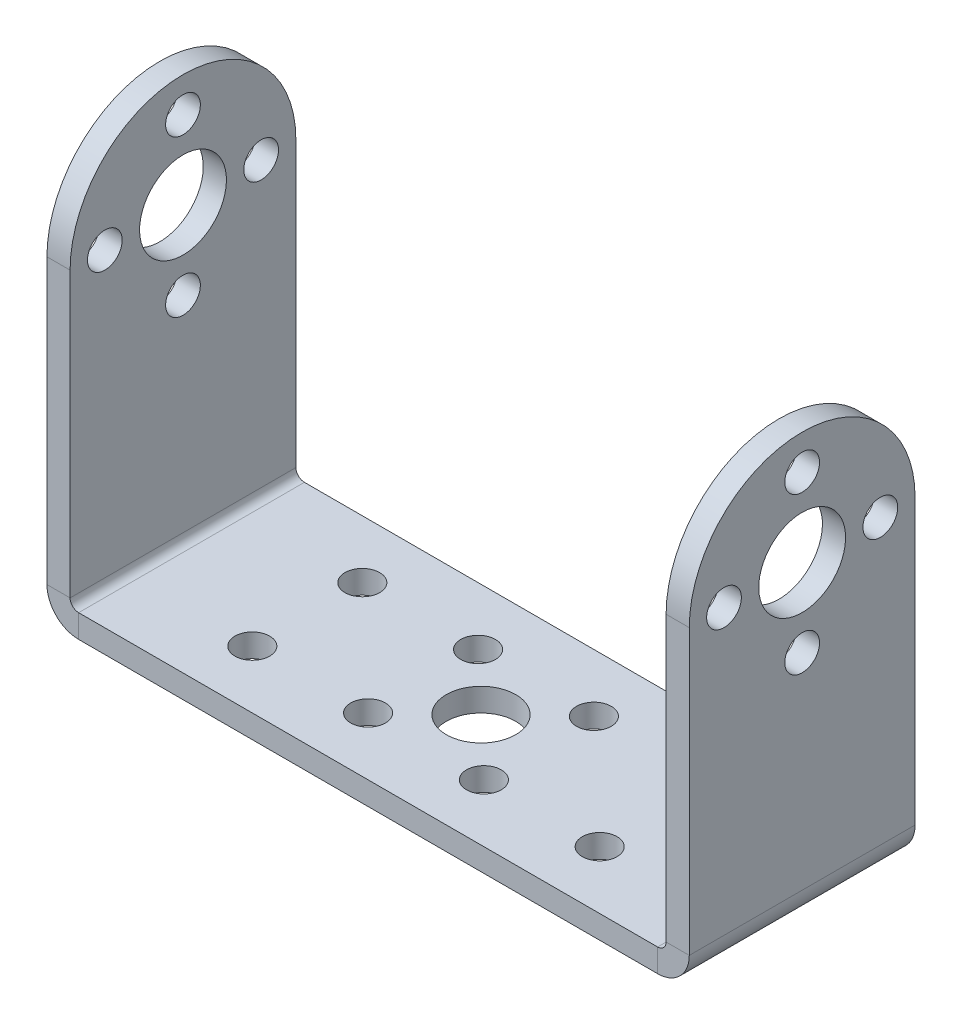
ISO-10303-21;
HEADER;
FILE_DESCRIPTION(('STEP AP214'),'2;1');
FILE_NAME('part.step','',(''),(''),'','','');
FILE_SCHEMA(('AUTOMOTIVE_DESIGN { 1 0 10303 214 1 1 1 1 }'));
ENDSEC;
DATA;
#1=APPLICATION_CONTEXT('core data for automotive mechanical design processes');
#2=APPLICATION_PROTOCOL_DEFINITION('international standard','automotive_design',2000,#1);
#3=PRODUCT_CONTEXT('',#1,'mechanical');
#4=PRODUCT('Part','Part','',(#3));
#5=PRODUCT_RELATED_PRODUCT_CATEGORY('part','',(#4));
#6=PRODUCT_DEFINITION_FORMATION('','',#4);
#7=PRODUCT_DEFINITION_CONTEXT('part definition',#1,'design');
#8=PRODUCT_DEFINITION('design','',#6,#7);
#9=PRODUCT_DEFINITION_SHAPE('','',#8);
#10=(LENGTH_UNIT() NAMED_UNIT(*) SI_UNIT(.MILLI.,.METRE.));
#11=(NAMED_UNIT(*) PLANE_ANGLE_UNIT() SI_UNIT($,.RADIAN.));
#12=(NAMED_UNIT(*) SI_UNIT($,.STERADIAN.) SOLID_ANGLE_UNIT());
#13=UNCERTAINTY_MEASURE_WITH_UNIT(LENGTH_MEASURE(1.E-05),#10,'distance_accuracy_value','');
#14=(GEOMETRIC_REPRESENTATION_CONTEXT(3) GLOBAL_UNCERTAINTY_ASSIGNED_CONTEXT((#13)) GLOBAL_UNIT_ASSIGNED_CONTEXT((#10,
#11,#12)) REPRESENTATION_CONTEXT('',''));
#15=CARTESIAN_POINT('',(0.,0.,0.));
#16=DIRECTION('',(0.,0.,1.));
#17=DIRECTION('',(1.,0.,0.));
#18=AXIS2_PLACEMENT_3D('',#15,#16,#17);
#19=CARTESIAN_POINT('',(-27.7366,0.,0.));
#20=DIRECTION('',(1.,0.,0.));
#21=DIRECTION('',(0.,1.,0.));
#22=AXIS2_PLACEMENT_3D('',#19,#20,#21);
#23=PLANE('',#22);
#24=CARTESIAN_POINT('',(-27.7366000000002,34.0000000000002,0.));
#25=DIRECTION('',(1.,0.,0.));
#26=DIRECTION('',(0.,1.,0.));
#27=AXIS2_PLACEMENT_3D('',#24,#25,#26);
#28=CIRCLE('',#27,1.5);
#29=CARTESIAN_POINT('',(-27.7366000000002,35.5000000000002,0.));
#30=VERTEX_POINT('',#29);
#31=EDGE_CURVE('E994',#30,#30,#28,.T.);
#32=ORIENTED_EDGE('',*,*,#31,.T.);
#33=EDGE_LOOP('',(#32));
#34=FACE_BOUND('',#33,.T.);
#35=CARTESIAN_POINT('',(-27.7366000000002,27.2500000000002,-6.75));
#36=DIRECTION('',(1.,0.,0.));
#37=DIRECTION('',(0.,-1.,0.));
#38=AXIS2_PLACEMENT_3D('',#35,#36,#37);
#39=CIRCLE('',#38,1.5);
#40=CARTESIAN_POINT('',(-27.7366000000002,28.7500000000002,-6.75));
#41=VERTEX_POINT('',#40);
#42=EDGE_CURVE('E982',#41,#41,#39,.T.);
#43=ORIENTED_EDGE('',*,*,#42,.T.);
#44=EDGE_LOOP('',(#43));
#45=FACE_BOUND('',#44,.T.);
#46=CARTESIAN_POINT('',(-27.7366000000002,27.2500000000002,6.75));
#47=DIRECTION('',(1.,0.,0.));
#48=DIRECTION('',(0.,1.,0.));
#49=AXIS2_PLACEMENT_3D('',#46,#47,#48);
#50=CIRCLE('',#49,1.5);
#51=CARTESIAN_POINT('',(-27.7366000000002,28.7500000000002,6.75));
#52=VERTEX_POINT('',#51);
#53=EDGE_CURVE('E983',#52,#52,#50,.T.);
#54=ORIENTED_EDGE('',*,*,#53,.T.);
#55=EDGE_LOOP('',(#54));
#56=FACE_BOUND('',#55,.T.);
#57=CARTESIAN_POINT('',(-27.7366000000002,20.5000000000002,0.));
#58=DIRECTION('',(1.,0.,0.));
#59=DIRECTION('',(0.,-1.,0.));
#60=AXIS2_PLACEMENT_3D('',#57,#58,#59);
#61=CIRCLE('',#60,1.5);
#62=CARTESIAN_POINT('',(-27.7366000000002,22.0000000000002,0.));
#63=VERTEX_POINT('',#62);
#64=EDGE_CURVE('E965',#63,#63,#61,.T.);
#65=ORIENTED_EDGE('',*,*,#64,.T.);
#66=EDGE_LOOP('',(#65));
#67=FACE_BOUND('',#66,.T.);
#68=CARTESIAN_POINT('',(-27.7366000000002,27.2500000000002,0.));
#69=DIRECTION('',(1.,0.,0.));
#70=DIRECTION('',(0.,1.,0.));
#71=AXIS2_PLACEMENT_3D('',#68,#69,#70);
#72=CIRCLE('',#71,3.75);
#73=CARTESIAN_POINT('',(-27.7366000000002,31.0000000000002,0.));
#74=VERTEX_POINT('',#73);
#75=EDGE_CURVE('E289',#74,#74,#72,.T.);
#76=ORIENTED_EDGE('',*,*,#75,.T.);
#77=EDGE_LOOP('',(#76));
#78=FACE_BOUND('',#77,.T.);
#79=CARTESIAN_POINT('',(-27.7366000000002,27.2500000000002,0.));
#80=DIRECTION('',(1.,0.,0.));
#81=DIRECTION('',(0.,1.,0.));
#82=AXIS2_PLACEMENT_3D('',#79,#80,#81);
#83=CIRCLE('',#82,9.75);
#84=CARTESIAN_POINT('',(-27.7366000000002,27.2500000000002,-9.75));
#85=VERTEX_POINT('',#84);
#86=CARTESIAN_POINT('',(-27.7366000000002,27.2500000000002,9.75));
#87=VERTEX_POINT('',#86);
#88=EDGE_CURVE('E328',#85,#87,#83,.T.);
#89=ORIENTED_EDGE('',*,*,#88,.F.);
#90=DIRECTION('',(0.,-1.,0.));
#91=VECTOR('',#90,1.);
#92=CARTESIAN_POINT('',(-27.7366,0.,-9.75));
#93=LINE('',#92,#91);
#94=CARTESIAN_POINT('',(-27.7366,2.73659999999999,-9.75));
#95=VERTEX_POINT('',#94);
#96=EDGE_CURVE('E254',#85,#95,#93,.T.);
#97=ORIENTED_EDGE('',*,*,#96,.T.);
#98=DIRECTION('',(0.,0.,1.));
#99=VECTOR('',#98,1.);
#100=CARTESIAN_POINT('',(-27.7366,2.73659999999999,-9.75));
#101=LINE('',#100,#99);
#102=CARTESIAN_POINT('',(-27.7366,2.73659999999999,9.75));
#103=VERTEX_POINT('',#102);
#104=EDGE_CURVE('E399',#103,#95,#101,.F.);
#105=ORIENTED_EDGE('',*,*,#104,.F.);
#106=DIRECTION('',(0.,1.,0.));
#107=VECTOR('',#106,1.);
#108=CARTESIAN_POINT('',(-27.7366,0.,9.75));
#109=LINE('',#108,#107);
#110=EDGE_CURVE('E388',#103,#87,#109,.T.);
#111=ORIENTED_EDGE('',*,*,#110,.T.);
#112=EDGE_LOOP('',(#89,#97,#105,#111));
#113=FACE_BOUND('',#112,.T.);
#114=ADVANCED_FACE('F95',(#34,#45,#56,#67,#78,#113),#23,.F.);
#115=CARTESIAN_POINT('',(-25.7366,0.,0.));
#116=DIRECTION('',(1.,0.,0.));
#117=DIRECTION('',(0.,1.,0.));
#118=AXIS2_PLACEMENT_3D('',#115,#116,#117);
#119=PLANE('',#118);
#120=CARTESIAN_POINT('',(-25.7366000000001,34.0000000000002,0.));
#121=DIRECTION('',(1.,0.,0.));
#122=DIRECTION('',(0.,1.,0.));
#123=AXIS2_PLACEMENT_3D('',#120,#121,#122);
#124=CIRCLE('',#123,1.5);
#125=CARTESIAN_POINT('',(-25.7366000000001,35.5000000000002,0.));
#126=VERTEX_POINT('',#125);
#127=EDGE_CURVE('E320',#126,#126,#124,.T.);
#128=ORIENTED_EDGE('',*,*,#127,.F.);
#129=EDGE_LOOP('',(#128));
#130=FACE_BOUND('',#129,.T.);
#131=CARTESIAN_POINT('',(-25.7366000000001,27.2500000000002,-6.75));
#132=DIRECTION('',(1.,0.,0.));
#133=DIRECTION('',(0.,1.,0.));
#134=AXIS2_PLACEMENT_3D('',#131,#132,#133);
#135=CIRCLE('',#134,1.5);
#136=CARTESIAN_POINT('',(-25.7366000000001,28.7500000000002,-6.75));
#137=VERTEX_POINT('',#136);
#138=EDGE_CURVE('E302',#137,#137,#135,.T.);
#139=ORIENTED_EDGE('',*,*,#138,.F.);
#140=EDGE_LOOP('',(#139));
#141=FACE_BOUND('',#140,.T.);
#142=CARTESIAN_POINT('',(-25.7366000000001,27.2500000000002,6.75));
#143=DIRECTION('',(1.,0.,0.));
#144=DIRECTION('',(0.,1.,0.));
#145=AXIS2_PLACEMENT_3D('',#142,#143,#144);
#146=CIRCLE('',#145,1.5);
#147=CARTESIAN_POINT('',(-25.7366000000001,28.7500000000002,6.75));
#148=VERTEX_POINT('',#147);
#149=EDGE_CURVE('E298',#148,#148,#146,.T.);
#150=ORIENTED_EDGE('',*,*,#149,.F.);
#151=EDGE_LOOP('',(#150));
#152=FACE_BOUND('',#151,.T.);
#153=CARTESIAN_POINT('',(-25.7366000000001,20.5000000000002,0.));
#154=DIRECTION('',(1.,0.,0.));
#155=DIRECTION('',(0.,1.,0.));
#156=AXIS2_PLACEMENT_3D('',#153,#154,#155);
#157=CIRCLE('',#156,1.5);
#158=CARTESIAN_POINT('',(-25.7366000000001,22.0000000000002,0.));
#159=VERTEX_POINT('',#158);
#160=EDGE_CURVE('E294',#159,#159,#157,.T.);
#161=ORIENTED_EDGE('',*,*,#160,.F.);
#162=EDGE_LOOP('',(#161));
#163=FACE_BOUND('',#162,.T.);
#164=CARTESIAN_POINT('',(-25.7366000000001,27.2500000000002,0.));
#165=DIRECTION('',(1.,0.,0.));
#166=DIRECTION('',(0.,1.,0.));
#167=AXIS2_PLACEMENT_3D('',#164,#165,#166);
#168=CIRCLE('',#167,3.75);
#169=CARTESIAN_POINT('',(-25.7366000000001,31.0000000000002,0.));
#170=VERTEX_POINT('',#169);
#171=EDGE_CURVE('E288',#170,#170,#168,.T.);
#172=ORIENTED_EDGE('',*,*,#171,.F.);
#173=EDGE_LOOP('',(#172));
#174=FACE_BOUND('',#173,.T.);
#175=DIRECTION('',(0.,1.,0.));
#176=VECTOR('',#175,1.);
#177=CARTESIAN_POINT('',(-25.7366,2.,-9.75));
#178=LINE('',#177,#176);
#179=CARTESIAN_POINT('',(-25.7366000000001,27.2500000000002,-9.75));
#180=VERTEX_POINT('',#179);
#181=CARTESIAN_POINT('',(-25.7366,2.7366,-9.75));
#182=VERTEX_POINT('',#181);
#183=EDGE_CURVE('E392',#180,#182,#178,.F.);
#184=ORIENTED_EDGE('',*,*,#183,.F.);
#185=CARTESIAN_POINT('',(-25.7366000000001,27.2500000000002,0.));
#186=DIRECTION('',(1.,0.,0.));
#187=DIRECTION('',(0.,1.,0.));
#188=AXIS2_PLACEMENT_3D('',#185,#186,#187);
#189=CIRCLE('',#188,9.75);
#190=CARTESIAN_POINT('',(-25.7366000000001,27.2500000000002,9.75));
#191=VERTEX_POINT('',#190);
#192=EDGE_CURVE('E283',#180,#191,#189,.T.);
#193=ORIENTED_EDGE('',*,*,#192,.T.);
#194=DIRECTION('',(0.,-1.,0.));
#195=VECTOR('',#194,1.);
#196=CARTESIAN_POINT('',(-25.7366000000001,37.,9.74999999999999));
#197=LINE('',#196,#195);
#198=CARTESIAN_POINT('',(-25.7366,2.7366,9.75));
#199=VERTEX_POINT('',#198);
#200=EDGE_CURVE('E395',#199,#191,#197,.F.);
#201=ORIENTED_EDGE('',*,*,#200,.F.);
#202=DIRECTION('',(0.,0.,1.));
#203=VECTOR('',#202,1.);
#204=CARTESIAN_POINT('',(-25.7366,2.7366,-9.75));
#205=LINE('',#204,#203);
#206=EDGE_CURVE('E406',#182,#199,#205,.T.);
#207=ORIENTED_EDGE('',*,*,#206,.F.);
#208=EDGE_LOOP('',(#184,#193,#201,#207));
#209=FACE_BOUND('',#208,.T.);
#210=ADVANCED_FACE('F417',(#130,#141,#152,#163,#174,#209),#119,.T.);
#211=CARTESIAN_POINT('',(27.7366,0.,0.));
#212=DIRECTION('',(-1.,0.,0.));
#213=DIRECTION('',(0.,-1.,0.));
#214=AXIS2_PLACEMENT_3D('',#211,#212,#213);
#215=PLANE('',#214);
#216=CARTESIAN_POINT('',(27.7366000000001,34.,0.));
#217=DIRECTION('',(1.,0.,0.));
#218=DIRECTION('',(0.,1.,0.));
#219=AXIS2_PLACEMENT_3D('',#216,#217,#218);
#220=CIRCLE('',#219,1.5);
#221=CARTESIAN_POINT('',(27.7366000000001,35.5,0.));
#222=VERTEX_POINT('',#221);
#223=EDGE_CURVE('E989',#222,#222,#220,.T.);
#224=ORIENTED_EDGE('',*,*,#223,.F.);
#225=EDGE_LOOP('',(#224));
#226=FACE_BOUND('',#225,.T.);
#227=CARTESIAN_POINT('',(27.7366000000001,27.25,-6.75));
#228=DIRECTION('',(1.,0.,0.));
#229=DIRECTION('',(0.,-1.,0.));
#230=AXIS2_PLACEMENT_3D('',#227,#228,#229);
#231=CIRCLE('',#230,1.5);
#232=CARTESIAN_POINT('',(27.7366000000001,28.75,-6.75));
#233=VERTEX_POINT('',#232);
#234=EDGE_CURVE('E997',#233,#233,#231,.T.);
#235=ORIENTED_EDGE('',*,*,#234,.F.);
#236=EDGE_LOOP('',(#235));
#237=FACE_BOUND('',#236,.T.);
#238=CARTESIAN_POINT('',(27.7366000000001,27.25,6.75));
#239=DIRECTION('',(1.,0.,0.));
#240=DIRECTION('',(0.,1.,0.));
#241=AXIS2_PLACEMENT_3D('',#238,#239,#240);
#242=CIRCLE('',#241,1.5);
#243=CARTESIAN_POINT('',(27.7366000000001,28.75,6.75));
#244=VERTEX_POINT('',#243);
#245=EDGE_CURVE('E979',#244,#244,#242,.T.);
#246=ORIENTED_EDGE('',*,*,#245,.F.);
#247=EDGE_LOOP('',(#246));
#248=FACE_BOUND('',#247,.T.);
#249=CARTESIAN_POINT('',(27.7366000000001,20.5,0.));
#250=DIRECTION('',(1.,0.,0.));
#251=DIRECTION('',(0.,-1.,0.));
#252=AXIS2_PLACEMENT_3D('',#249,#250,#251);
#253=CIRCLE('',#252,1.5);
#254=CARTESIAN_POINT('',(27.7366000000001,22.,0.));
#255=VERTEX_POINT('',#254);
#256=EDGE_CURVE('E971',#255,#255,#253,.T.);
#257=ORIENTED_EDGE('',*,*,#256,.F.);
#258=EDGE_LOOP('',(#257));
#259=FACE_BOUND('',#258,.T.);
#260=CARTESIAN_POINT('',(27.7366000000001,27.25,0.));
#261=DIRECTION('',(1.,0.,0.));
#262=DIRECTION('',(0.,1.,0.));
#263=AXIS2_PLACEMENT_3D('',#260,#261,#262);
#264=CIRCLE('',#263,3.75);
#265=CARTESIAN_POINT('',(27.7366000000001,31.,0.));
#266=VERTEX_POINT('',#265);
#267=EDGE_CURVE('E993',#266,#266,#264,.T.);
#268=ORIENTED_EDGE('',*,*,#267,.F.);
#269=EDGE_LOOP('',(#268));
#270=FACE_BOUND('',#269,.T.);
#271=DIRECTION('',(0.,1.,0.));
#272=VECTOR('',#271,1.);
#273=CARTESIAN_POINT('',(27.7366,0.,-9.75));
#274=LINE('',#273,#272);
#275=CARTESIAN_POINT('',(27.7366,2.73659999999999,-9.75));
#276=VERTEX_POINT('',#275);
#277=CARTESIAN_POINT('',(27.7366000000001,27.25,-9.75));
#278=VERTEX_POINT('',#277);
#279=EDGE_CURVE('E348',#276,#278,#274,.T.);
#280=ORIENTED_EDGE('',*,*,#279,.T.);
#281=CARTESIAN_POINT('',(27.7366000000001,27.25,0.));
#282=DIRECTION('',(1.,0.,0.));
#283=DIRECTION('',(0.,1.,0.));
#284=AXIS2_PLACEMENT_3D('',#281,#282,#283);
#285=CIRCLE('',#284,9.75);
#286=CARTESIAN_POINT('',(27.7366000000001,27.25,9.75));
#287=VERTEX_POINT('',#286);
#288=EDGE_CURVE('E280',#278,#287,#285,.T.);
#289=ORIENTED_EDGE('',*,*,#288,.T.);
#290=DIRECTION('',(0.,-1.,0.));
#291=VECTOR('',#290,1.);
#292=CARTESIAN_POINT('',(27.7366,0.,9.75));
#293=LINE('',#292,#291);
#294=CARTESIAN_POINT('',(27.7366,2.73659999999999,9.75));
#295=VERTEX_POINT('',#294);
#296=EDGE_CURVE('E344',#287,#295,#293,.T.);
#297=ORIENTED_EDGE('',*,*,#296,.T.);
#298=DIRECTION('',(0.,0.,-1.));
#299=VECTOR('',#298,1.);
#300=CARTESIAN_POINT('',(27.7366,2.73659999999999,9.75));
#301=LINE('',#300,#299);
#302=EDGE_CURVE('E359',#276,#295,#301,.F.);
#303=ORIENTED_EDGE('',*,*,#302,.F.);
#304=EDGE_LOOP('',(#280,#289,#297,#303));
#305=FACE_BOUND('',#304,.T.);
#306=ADVANCED_FACE('F457',(#226,#237,#248,#259,#270,#305),#215,.F.);
#307=CARTESIAN_POINT('',(25.7366,0.,0.));
#308=DIRECTION('',(-1.,0.,0.));
#309=DIRECTION('',(0.,-1.,0.));
#310=AXIS2_PLACEMENT_3D('',#307,#308,#309);
#311=PLANE('',#310);
#312=CARTESIAN_POINT('',(25.7366000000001,34.,0.));
#313=DIRECTION('',(-1.,0.,0.));
#314=DIRECTION('',(0.,-1.,0.));
#315=AXIS2_PLACEMENT_3D('',#312,#313,#314);
#316=CIRCLE('',#315,1.5);
#317=CARTESIAN_POINT('',(25.7366000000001,35.5,0.));
#318=VERTEX_POINT('',#317);
#319=EDGE_CURVE('E99',#318,#318,#316,.T.);
#320=ORIENTED_EDGE('',*,*,#319,.F.);
#321=EDGE_LOOP('',(#320));
#322=FACE_BOUND('',#321,.T.);
#323=CARTESIAN_POINT('',(25.7366000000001,27.25,-6.75));
#324=DIRECTION('',(-1.,0.,0.));
#325=DIRECTION('',(0.,-1.,0.));
#326=AXIS2_PLACEMENT_3D('',#323,#324,#325);
#327=CIRCLE('',#326,1.5);
#328=CARTESIAN_POINT('',(25.7366000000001,28.75,-6.75));
#329=VERTEX_POINT('',#328);
#330=EDGE_CURVE('E299',#329,#329,#327,.T.);
#331=ORIENTED_EDGE('',*,*,#330,.F.);
#332=EDGE_LOOP('',(#331));
#333=FACE_BOUND('',#332,.T.);
#334=CARTESIAN_POINT('',(25.7366000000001,27.25,6.75));
#335=DIRECTION('',(-1.,0.,0.));
#336=DIRECTION('',(0.,-1.,0.));
#337=AXIS2_PLACEMENT_3D('',#334,#335,#336);
#338=CIRCLE('',#337,1.5);
#339=CARTESIAN_POINT('',(25.7366000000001,28.75,6.75));
#340=VERTEX_POINT('',#339);
#341=EDGE_CURVE('E295',#340,#340,#338,.T.);
#342=ORIENTED_EDGE('',*,*,#341,.F.);
#343=EDGE_LOOP('',(#342));
#344=FACE_BOUND('',#343,.T.);
#345=CARTESIAN_POINT('',(25.7366,20.5,0.));
#346=DIRECTION('',(-1.,0.,0.));
#347=DIRECTION('',(0.,-1.,0.));
#348=AXIS2_PLACEMENT_3D('',#345,#346,#347);
#349=CIRCLE('',#348,1.5);
#350=CARTESIAN_POINT('',(25.7366,22.,0.));
#351=VERTEX_POINT('',#350);
#352=EDGE_CURVE('E290',#351,#351,#349,.T.);
#353=ORIENTED_EDGE('',*,*,#352,.F.);
#354=EDGE_LOOP('',(#353));
#355=FACE_BOUND('',#354,.T.);
#356=CARTESIAN_POINT('',(25.7366000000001,27.25,0.));
#357=DIRECTION('',(-1.,0.,0.));
#358=DIRECTION('',(0.,-1.,0.));
#359=AXIS2_PLACEMENT_3D('',#356,#357,#358);
#360=CIRCLE('',#359,3.75);
#361=CARTESIAN_POINT('',(25.7366000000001,31.,0.));
#362=VERTEX_POINT('',#361);
#363=EDGE_CURVE('E284',#362,#362,#360,.T.);
#364=ORIENTED_EDGE('',*,*,#363,.F.);
#365=EDGE_LOOP('',(#364));
#366=FACE_BOUND('',#365,.T.);
#367=CARTESIAN_POINT('',(25.7366000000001,27.25,0.));
#368=DIRECTION('',(-1.,0.,0.));
#369=DIRECTION('',(0.,-1.,0.));
#370=AXIS2_PLACEMENT_3D('',#367,#368,#369);
#371=CIRCLE('',#370,9.75);
#372=CARTESIAN_POINT('',(25.7366000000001,27.25,9.75));
#373=VERTEX_POINT('',#372);
#374=CARTESIAN_POINT('',(25.7366,27.25,-9.75));
#375=VERTEX_POINT('',#374);
#376=EDGE_CURVE('E157',#373,#375,#371,.T.);
#377=ORIENTED_EDGE('',*,*,#376,.T.);
#378=DIRECTION('',(0.,-1.,0.));
#379=VECTOR('',#378,1.);
#380=CARTESIAN_POINT('',(25.7366000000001,37.,-9.75));
#381=LINE('',#380,#379);
#382=CARTESIAN_POINT('',(25.7366,2.7366,-9.75));
#383=VERTEX_POINT('',#382);
#384=EDGE_CURVE('E355',#383,#375,#381,.F.);
#385=ORIENTED_EDGE('',*,*,#384,.F.);
#386=DIRECTION('',(0.,0.,-1.));
#387=VECTOR('',#386,1.);
#388=CARTESIAN_POINT('',(25.7366,2.7366,9.75));
#389=LINE('',#388,#387);
#390=CARTESIAN_POINT('',(25.7366,2.7366,9.75));
#391=VERTEX_POINT('',#390);
#392=EDGE_CURVE('E366',#391,#383,#389,.T.);
#393=ORIENTED_EDGE('',*,*,#392,.F.);
#394=DIRECTION('',(0.,1.,0.));
#395=VECTOR('',#394,1.);
#396=CARTESIAN_POINT('',(25.7366,2.,9.75));
#397=LINE('',#396,#395);
#398=EDGE_CURVE('E352',#373,#391,#397,.F.);
#399=ORIENTED_EDGE('',*,*,#398,.F.);
#400=EDGE_LOOP('',(#377,#385,#393,#399));
#401=FACE_BOUND('',#400,.T.);
#402=ADVANCED_FACE('F448',(#322,#333,#344,#355,#366,#401),#311,.T.);
#403=CARTESIAN_POINT('',(-27.7366000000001,37.,9.74999999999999));
#404=DIRECTION('',(0.,0.,-1.));
#405=DIRECTION('',(0.,1.,0.));
#406=AXIS2_PLACEMENT_3D('',#403,#404,#405);
#407=PLANE('',#406);
#408=DIRECTION('',(1.,0.,0.));
#409=VECTOR('',#408,1.);
#410=CARTESIAN_POINT('',(-27.7366000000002,27.2500000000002,9.75));
#411=LINE('',#410,#409);
#412=EDGE_CURVE('E334',#87,#191,#411,.T.);
#413=ORIENTED_EDGE('',*,*,#412,.F.);
#414=ORIENTED_EDGE('',*,*,#110,.F.);
#415=DIRECTION('',(1.,0.,0.));
#416=VECTOR('',#415,1.);
#417=CARTESIAN_POINT('',(-25.7366,2.7366,9.75));
#418=LINE('',#417,#416);
#419=EDGE_CURVE('E403',#199,#103,#418,.F.);
#420=ORIENTED_EDGE('',*,*,#419,.F.);
#421=ORIENTED_EDGE('',*,*,#200,.T.);
#422=EDGE_LOOP('',(#413,#414,#420,#421));
#423=FACE_BOUND('',#422,.T.);
#424=ADVANCED_FACE('F427',(#423),#407,.F.);
#425=CARTESIAN_POINT('',(27.7366,1.99999999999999,9.75));
#426=DIRECTION('',(0.,0.,-1.));
#427=DIRECTION('',(-1.,0.,0.));
#428=AXIS2_PLACEMENT_3D('',#425,#426,#427);
#429=PLANE('',#428);
#430=EDGE_CURVE('E143',#373,#287,#411,.T.);
#431=ORIENTED_EDGE('',*,*,#430,.F.);
#432=ORIENTED_EDGE('',*,*,#398,.T.);
#433=DIRECTION('',(-1.,0.,0.));
#434=VECTOR('',#433,1.);
#435=CARTESIAN_POINT('',(27.7366,2.73659999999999,9.75));
#436=LINE('',#435,#434);
#437=EDGE_CURVE('E343',#391,#295,#436,.F.);
#438=ORIENTED_EDGE('',*,*,#437,.T.);
#439=ORIENTED_EDGE('',*,*,#296,.F.);
#440=EDGE_LOOP('',(#431,#432,#438,#439));
#441=FACE_BOUND('',#440,.T.);
#442=ADVANCED_FACE('F447',(#441),#429,.F.);
#443=CARTESIAN_POINT('',(-25.,2.,-9.75));
#444=DIRECTION('',(0.,0.,1.));
#445=DIRECTION('',(1.,0.,0.));
#446=AXIS2_PLACEMENT_3D('',#443,#444,#445);
#447=PLANE('',#446);
#448=DIRECTION('',(-1.,0.,0.));
#449=VECTOR('',#448,1.);
#450=CARTESIAN_POINT('',(-25.,0.,-9.75));
#451=LINE('',#450,#449);
#452=CARTESIAN_POINT('',(25.,0.,-9.75));
#453=VERTEX_POINT('',#452);
#454=CARTESIAN_POINT('',(-25.,0.,-9.75));
#455=VERTEX_POINT('',#454);
#456=EDGE_CURVE('E223',#453,#455,#451,.T.);
#457=ORIENTED_EDGE('',*,*,#456,.T.);
#458=DIRECTION('',(0.,-1.,0.));
#459=VECTOR('',#458,1.);
#460=CARTESIAN_POINT('',(-25.,2.,-9.75));
#461=LINE('',#460,#459);
#462=CARTESIAN_POINT('',(-25.,2.,-9.75));
#463=VERTEX_POINT('',#462);
#464=EDGE_CURVE('E105',#463,#455,#461,.T.);
#465=ORIENTED_EDGE('',*,*,#464,.F.);
#466=DIRECTION('',(-1.,0.,0.));
#467=VECTOR('',#466,1.);
#468=CARTESIAN_POINT('',(-25.,2.,-9.75));
#469=LINE('',#468,#467);
#470=CARTESIAN_POINT('',(25.,2.,-9.75));
#471=VERTEX_POINT('',#470);
#472=EDGE_CURVE('E210',#471,#463,#469,.T.);
#473=ORIENTED_EDGE('',*,*,#472,.F.);
#474=DIRECTION('',(0.,-1.,0.));
#475=VECTOR('',#474,1.);
#476=CARTESIAN_POINT('',(25.,2.,-9.75));
#477=LINE('',#476,#475);
#478=EDGE_CURVE('E13',#471,#453,#477,.T.);
#479=ORIENTED_EDGE('',*,*,#478,.T.);
#480=EDGE_LOOP('',(#457,#465,#473,#479));
#481=FACE_BOUND('',#480,.T.);
#482=ADVANCED_FACE('F97',(#481),#447,.F.);
#483=CARTESIAN_POINT('',(-25.,2.,9.75));
#484=DIRECTION('',(0.,0.,-1.));
#485=DIRECTION('',(-1.,0.,0.));
#486=AXIS2_PLACEMENT_3D('',#483,#484,#485);
#487=PLANE('',#486);
#488=DIRECTION('',(1.,0.,0.));
#489=VECTOR('',#488,1.);
#490=CARTESIAN_POINT('',(-25.,0.,9.75));
#491=LINE('',#490,#489);
#492=CARTESIAN_POINT('',(-25.,0.,9.75));
#493=VERTEX_POINT('',#492);
#494=CARTESIAN_POINT('',(25.,0.,9.75));
#495=VERTEX_POINT('',#494);
#496=EDGE_CURVE('E259',#493,#495,#491,.T.);
#497=ORIENTED_EDGE('',*,*,#496,.T.);
#498=DIRECTION('',(0.,-1.,0.));
#499=VECTOR('',#498,1.);
#500=CARTESIAN_POINT('',(25.,2.,9.75));
#501=LINE('',#500,#499);
#502=CARTESIAN_POINT('',(25.,2.,9.75));
#503=VERTEX_POINT('',#502);
#504=EDGE_CURVE('E263',#503,#495,#501,.T.);
#505=ORIENTED_EDGE('',*,*,#504,.F.);
#506=DIRECTION('',(1.,0.,0.));
#507=VECTOR('',#506,1.);
#508=CARTESIAN_POINT('',(-25.,2.,9.75));
#509=LINE('',#508,#507);
#510=CARTESIAN_POINT('',(-25.,2.,9.75));
#511=VERTEX_POINT('',#510);
#512=EDGE_CURVE('E117',#511,#503,#509,.T.);
#513=ORIENTED_EDGE('',*,*,#512,.F.);
#514=DIRECTION('',(0.,-1.,0.));
#515=VECTOR('',#514,1.);
#516=CARTESIAN_POINT('',(-25.,2.,9.75));
#517=LINE('',#516,#515);
#518=EDGE_CURVE('E229',#511,#493,#517,.T.);
#519=ORIENTED_EDGE('',*,*,#518,.T.);
#520=EDGE_LOOP('',(#497,#505,#513,#519));
#521=FACE_BOUND('',#520,.T.);
#522=ADVANCED_FACE('F435',(#521),#487,.F.);
#523=CARTESIAN_POINT('',(0.,2.,0.));
#524=DIRECTION('',(0.,-1.,0.));
#525=DIRECTION('',(0.,0.,-1.));
#526=AXIS2_PLACEMENT_3D('',#523,#524,#525);
#527=PLANE('',#526);
#528=CARTESIAN_POINT('',(-15.,2.,-4.75));
#529=DIRECTION('',(0.,-1.,0.));
#530=DIRECTION('',(0.,0.,-1.));
#531=AXIS2_PLACEMENT_3D('',#528,#529,#530);
#532=CIRCLE('',#531,1.5);
#533=CARTESIAN_POINT('',(-15.,2.,-6.25));
#534=VERTEX_POINT('',#533);
#535=EDGE_CURVE('E963',#534,#534,#532,.T.);
#536=ORIENTED_EDGE('',*,*,#535,.T.);
#537=EDGE_LOOP('',(#536));
#538=FACE_BOUND('',#537,.T.);
#539=CARTESIAN_POINT('',(-15.,2.,4.75));
#540=DIRECTION('',(0.,-1.,0.));
#541=DIRECTION('',(0.,0.,-1.));
#542=AXIS2_PLACEMENT_3D('',#539,#540,#541);
#543=CIRCLE('',#542,1.5);
#544=CARTESIAN_POINT('',(-15.,2.,3.25));
#545=VERTEX_POINT('',#544);
#546=EDGE_CURVE('E966',#545,#545,#543,.T.);
#547=ORIENTED_EDGE('',*,*,#546,.T.);
#548=EDGE_LOOP('',(#547));
#549=FACE_BOUND('',#548,.T.);
#550=CARTESIAN_POINT('',(-5.,2.,-4.75));
#551=DIRECTION('',(0.,-1.,0.));
#552=DIRECTION('',(0.,0.,-1.));
#553=AXIS2_PLACEMENT_3D('',#550,#551,#552);
#554=CIRCLE('',#553,1.5);
#555=CARTESIAN_POINT('',(-5.,2.,-6.25));
#556=VERTEX_POINT('',#555);
#557=EDGE_CURVE('E975',#556,#556,#554,.T.);
#558=ORIENTED_EDGE('',*,*,#557,.T.);
#559=EDGE_LOOP('',(#558));
#560=FACE_BOUND('',#559,.T.);
#561=CARTESIAN_POINT('',(15.,2.,4.75000000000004));
#562=DIRECTION('',(0.,-1.,0.));
#563=DIRECTION('',(0.,0.,-1.));
#564=AXIS2_PLACEMENT_3D('',#561,#562,#563);
#565=CIRCLE('',#564,1.5);
#566=CARTESIAN_POINT('',(15.,2.,3.25000000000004));
#567=VERTEX_POINT('',#566);
#568=EDGE_CURVE('E1048',#567,#567,#565,.T.);
#569=ORIENTED_EDGE('',*,*,#568,.T.);
#570=EDGE_LOOP('',(#569));
#571=FACE_BOUND('',#570,.T.);
#572=CARTESIAN_POINT('',(4.99999999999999,2.,4.75000000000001));
#573=DIRECTION('',(0.,-1.,0.));
#574=DIRECTION('',(0.,0.,-1.));
#575=AXIS2_PLACEMENT_3D('',#572,#573,#574);
#576=CIRCLE('',#575,1.5);
#577=CARTESIAN_POINT('',(4.99999999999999,2.,3.25000000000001));
#578=VERTEX_POINT('',#577);
#579=EDGE_CURVE('E1041',#578,#578,#576,.T.);
#580=ORIENTED_EDGE('',*,*,#579,.T.);
#581=EDGE_LOOP('',(#580));
#582=FACE_BOUND('',#581,.T.);
#583=CARTESIAN_POINT('',(5.00000000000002,2.,-4.74999999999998));
#584=DIRECTION('',(0.,-1.,0.));
#585=DIRECTION('',(0.,0.,-1.));
#586=AXIS2_PLACEMENT_3D('',#583,#584,#585);
#587=CIRCLE('',#586,1.5);
#588=CARTESIAN_POINT('',(5.00000000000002,2.,-6.24999999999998));
#589=VERTEX_POINT('',#588);
#590=EDGE_CURVE('E1038',#589,#589,#587,.T.);
#591=ORIENTED_EDGE('',*,*,#590,.T.);
#592=EDGE_LOOP('',(#591));
#593=FACE_BOUND('',#592,.T.);
#594=CARTESIAN_POINT('',(15.,2.,-4.74999999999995));
#595=DIRECTION('',(0.,-1.,0.));
#596=DIRECTION('',(0.,0.,-1.));
#597=AXIS2_PLACEMENT_3D('',#594,#595,#596);
#598=CIRCLE('',#597,1.5);
#599=CARTESIAN_POINT('',(15.,2.,-6.24999999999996));
#600=VERTEX_POINT('',#599);
#601=EDGE_CURVE('E1029',#600,#600,#598,.T.);
#602=ORIENTED_EDGE('',*,*,#601,.T.);
#603=EDGE_LOOP('',(#602));
#604=FACE_BOUND('',#603,.T.);
#605=CARTESIAN_POINT('',(-5.,2.,4.75));
#606=DIRECTION('',(0.,-1.,0.));
#607=DIRECTION('',(0.,0.,-1.));
#608=AXIS2_PLACEMENT_3D('',#605,#606,#607);
#609=CIRCLE('',#608,1.5);
#610=CARTESIAN_POINT('',(-5.,2.,3.25));
#611=VERTEX_POINT('',#610);
#612=EDGE_CURVE('E1026',#611,#611,#609,.T.);
#613=ORIENTED_EDGE('',*,*,#612,.T.);
#614=EDGE_LOOP('',(#613));
#615=FACE_BOUND('',#614,.T.);
#616=CARTESIAN_POINT('',(0.,2.,0.));
#617=DIRECTION('',(0.,-1.,0.));
#618=DIRECTION('',(0.,0.,-1.));
#619=AXIS2_PLACEMENT_3D('',#616,#617,#618);
#620=CIRCLE('',#619,3.);
#621=CARTESIAN_POINT('',(0.,2.,-3.));
#622=VERTEX_POINT('',#621);
#623=EDGE_CURVE('E1030',#622,#622,#620,.T.);
#624=ORIENTED_EDGE('',*,*,#623,.T.);
#625=EDGE_LOOP('',(#624));
#626=FACE_BOUND('',#625,.T.);
#627=DIRECTION('',(0.,0.,-1.));
#628=VECTOR('',#627,1.);
#629=CARTESIAN_POINT('',(25.,2.,9.75));
#630=LINE('',#629,#628);
#631=EDGE_CURVE('E216',#503,#471,#630,.T.);
#632=ORIENTED_EDGE('',*,*,#631,.T.);
#633=ORIENTED_EDGE('',*,*,#472,.T.);
#634=DIRECTION('',(0.,0.,1.));
#635=VECTOR('',#634,1.);
#636=CARTESIAN_POINT('',(-25.,2.,9.75));
#637=LINE('',#636,#635);
#638=EDGE_CURVE('E214',#463,#511,#637,.T.);
#639=ORIENTED_EDGE('',*,*,#638,.T.);
#640=ORIENTED_EDGE('',*,*,#512,.T.);
#641=EDGE_LOOP('',(#632,#633,#639,#640));
#642=FACE_BOUND('',#641,.T.);
#643=ADVANCED_FACE('F212',(#538,#549,#560,#571,#582,#593,#604,#615,#626,#642),#527,.F.);
#644=CARTESIAN_POINT('',(0.,0.,0.));
#645=DIRECTION('',(0.,-1.,0.));
#646=DIRECTION('',(0.,0.,-1.));
#647=AXIS2_PLACEMENT_3D('',#644,#645,#646);
#648=PLANE('',#647);
#649=CARTESIAN_POINT('',(-15.,0.,-4.75));
#650=DIRECTION('',(0.,-1.,0.));
#651=DIRECTION('',(0.,0.,-1.));
#652=AXIS2_PLACEMENT_3D('',#649,#650,#651);
#653=CIRCLE('',#652,1.5);
#654=CARTESIAN_POINT('',(-15.,0.,-6.25));
#655=VERTEX_POINT('',#654);
#656=EDGE_CURVE('E960',#655,#655,#653,.T.);
#657=ORIENTED_EDGE('',*,*,#656,.F.);
#658=EDGE_LOOP('',(#657));
#659=FACE_BOUND('',#658,.T.);
#660=CARTESIAN_POINT('',(-15.,0.,4.75));
#661=DIRECTION('',(0.,-1.,0.));
#662=DIRECTION('',(0.,0.,-1.));
#663=AXIS2_PLACEMENT_3D('',#660,#661,#662);
#664=CIRCLE('',#663,1.5);
#665=CARTESIAN_POINT('',(-15.,0.,3.25));
#666=VERTEX_POINT('',#665);
#667=EDGE_CURVE('E1055',#666,#666,#664,.T.);
#668=ORIENTED_EDGE('',*,*,#667,.F.);
#669=EDGE_LOOP('',(#668));
#670=FACE_BOUND('',#669,.T.);
#671=CARTESIAN_POINT('',(-5.,0.,-4.75));
#672=DIRECTION('',(0.,-1.,0.));
#673=DIRECTION('',(0.,0.,-1.));
#674=AXIS2_PLACEMENT_3D('',#671,#672,#673);
#675=CIRCLE('',#674,1.5);
#676=CARTESIAN_POINT('',(-5.,0.,-6.25));
#677=VERTEX_POINT('',#676);
#678=EDGE_CURVE('E1053',#677,#677,#675,.T.);
#679=ORIENTED_EDGE('',*,*,#678,.F.);
#680=EDGE_LOOP('',(#679));
#681=FACE_BOUND('',#680,.T.);
#682=CARTESIAN_POINT('',(15.,0.,4.75000000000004));
#683=DIRECTION('',(0.,-1.,0.));
#684=DIRECTION('',(0.,0.,1.));
#685=AXIS2_PLACEMENT_3D('',#682,#683,#684);
#686=CIRCLE('',#685,1.5);
#687=CARTESIAN_POINT('',(15.,0.,6.25000000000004));
#688=VERTEX_POINT('',#687);
#689=EDGE_CURVE('E1035',#688,#688,#686,.T.);
#690=ORIENTED_EDGE('',*,*,#689,.F.);
#691=EDGE_LOOP('',(#690));
#692=FACE_BOUND('',#691,.T.);
#693=CARTESIAN_POINT('',(4.99999999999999,0.,4.75000000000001));
#694=DIRECTION('',(0.,-1.,0.));
#695=DIRECTION('',(0.,0.,1.));
#696=AXIS2_PLACEMENT_3D('',#693,#694,#695);
#697=CIRCLE('',#696,1.5);
#698=CARTESIAN_POINT('',(4.99999999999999,0.,6.25000000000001));
#699=VERTEX_POINT('',#698);
#700=EDGE_CURVE('E1046',#699,#699,#697,.T.);
#701=ORIENTED_EDGE('',*,*,#700,.F.);
#702=EDGE_LOOP('',(#701));
#703=FACE_BOUND('',#702,.T.);
#704=CARTESIAN_POINT('',(5.00000000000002,0.,-4.74999999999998));
#705=DIRECTION('',(0.,-1.,0.));
#706=DIRECTION('',(0.,0.,1.));
#707=AXIS2_PLACEMENT_3D('',#704,#705,#706);
#708=CIRCLE('',#707,1.5);
#709=CARTESIAN_POINT('',(5.00000000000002,0.,-3.24999999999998));
#710=VERTEX_POINT('',#709);
#711=EDGE_CURVE('E1043',#710,#710,#708,.T.);
#712=ORIENTED_EDGE('',*,*,#711,.F.);
#713=EDGE_LOOP('',(#712));
#714=FACE_BOUND('',#713,.T.);
#715=CARTESIAN_POINT('',(15.,0.,-4.74999999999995));
#716=DIRECTION('',(0.,-1.,0.));
#717=DIRECTION('',(0.,0.,1.));
#718=AXIS2_PLACEMENT_3D('',#715,#716,#717);
#719=CIRCLE('',#718,1.5);
#720=CARTESIAN_POINT('',(15.,0.,-3.24999999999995));
#721=VERTEX_POINT('',#720);
#722=EDGE_CURVE('E1036',#721,#721,#719,.T.);
#723=ORIENTED_EDGE('',*,*,#722,.F.);
#724=EDGE_LOOP('',(#723));
#725=FACE_BOUND('',#724,.T.);
#726=CARTESIAN_POINT('',(-5.,0.,4.75));
#727=DIRECTION('',(0.,-1.,0.));
#728=DIRECTION('',(0.,0.,-1.));
#729=AXIS2_PLACEMENT_3D('',#726,#727,#728);
#730=CIRCLE('',#729,1.5);
#731=CARTESIAN_POINT('',(-5.,0.,3.25));
#732=VERTEX_POINT('',#731);
#733=EDGE_CURVE('E1032',#732,#732,#730,.T.);
#734=ORIENTED_EDGE('',*,*,#733,.F.);
#735=EDGE_LOOP('',(#734));
#736=FACE_BOUND('',#735,.T.);
#737=CARTESIAN_POINT('',(0.,0.,0.));
#738=DIRECTION('',(0.,-1.,0.));
#739=DIRECTION('',(0.,0.,-1.));
#740=AXIS2_PLACEMENT_3D('',#737,#738,#739);
#741=CIRCLE('',#740,3.);
#742=CARTESIAN_POINT('',(0.,0.,-3.));
#743=VERTEX_POINT('',#742);
#744=EDGE_CURVE('E1059',#743,#743,#741,.T.);
#745=ORIENTED_EDGE('',*,*,#744,.F.);
#746=EDGE_LOOP('',(#745));
#747=FACE_BOUND('',#746,.T.);
#748=DIRECTION('',(0.,0.,-1.));
#749=VECTOR('',#748,1.);
#750=CARTESIAN_POINT('',(25.,0.,9.75));
#751=LINE('',#750,#749);
#752=EDGE_CURVE('E264',#495,#453,#751,.T.);
#753=ORIENTED_EDGE('',*,*,#752,.F.);
#754=ORIENTED_EDGE('',*,*,#496,.F.);
#755=DIRECTION('',(0.,0.,1.));
#756=VECTOR('',#755,1.);
#757=CARTESIAN_POINT('',(-25.,0.,9.75));
#758=LINE('',#757,#756);
#759=EDGE_CURVE('E270',#455,#493,#758,.T.);
#760=ORIENTED_EDGE('',*,*,#759,.F.);
#761=ORIENTED_EDGE('',*,*,#456,.F.);
#762=EDGE_LOOP('',(#753,#754,#760,#761));
#763=FACE_BOUND('',#762,.T.);
#764=ADVANCED_FACE('F433',(#659,#670,#681,#692,#703,#714,#725,#736,#747,#763),#648,.T.);
#765=CARTESIAN_POINT('',(-25.,2.7366,-9.75));
#766=DIRECTION('',(0.,0.,-1.));
#767=DIRECTION('',(-1.,0.,0.));
#768=AXIS2_PLACEMENT_3D('',#765,#766,#767);
#769=PLANE('',#768);
#770=DIRECTION('',(1.,0.,0.));
#771=VECTOR('',#770,1.);
#772=CARTESIAN_POINT('',(-27.7366,2.73659999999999,-9.75));
#773=LINE('',#772,#771);
#774=EDGE_CURVE('E244',#182,#95,#773,.F.);
#775=ORIENTED_EDGE('',*,*,#774,.F.);
#776=CARTESIAN_POINT('',(-25.,2.7366,-9.75));
#777=DIRECTION('',(0.,0.,1.));
#778=DIRECTION('',(1.,0.,0.));
#779=AXIS2_PLACEMENT_3D('',#776,#777,#778);
#780=CIRCLE('',#779,0.7366);
#781=EDGE_CURVE('E235',#463,#182,#780,.F.);
#782=ORIENTED_EDGE('',*,*,#781,.F.);
#783=ORIENTED_EDGE('',*,*,#464,.T.);
#784=CARTESIAN_POINT('',(-25.,2.7366,-9.75));
#785=DIRECTION('',(0.,0.,1.));
#786=DIRECTION('',(1.,0.,0.));
#787=AXIS2_PLACEMENT_3D('',#784,#785,#786);
#788=CIRCLE('',#787,2.7366);
#789=EDGE_CURVE('E251',#455,#95,#788,.F.);
#790=ORIENTED_EDGE('',*,*,#789,.T.);
#791=EDGE_LOOP('',(#775,#782,#783,#790));
#792=FACE_BOUND('',#791,.T.);
#793=ADVANCED_FACE('F242',(#792),#769,.T.);
#794=CARTESIAN_POINT('',(-25.,2.7366,9.75));
#795=DIRECTION('',(0.,0.,-1.));
#796=DIRECTION('',(-1.,0.,0.));
#797=AXIS2_PLACEMENT_3D('',#794,#795,#796);
#798=PLANE('',#797);
#799=CARTESIAN_POINT('',(-25.,2.7366,9.75));
#800=DIRECTION('',(0.,0.,1.));
#801=DIRECTION('',(1.,0.,0.));
#802=AXIS2_PLACEMENT_3D('',#799,#800,#801);
#803=CIRCLE('',#802,0.7366);
#804=EDGE_CURVE('E238',#199,#511,#803,.T.);
#805=ORIENTED_EDGE('',*,*,#804,.F.);
#806=ORIENTED_EDGE('',*,*,#419,.T.);
#807=CARTESIAN_POINT('',(-25.,2.7366,9.75));
#808=DIRECTION('',(0.,0.,1.));
#809=DIRECTION('',(1.,0.,0.));
#810=AXIS2_PLACEMENT_3D('',#807,#808,#809);
#811=CIRCLE('',#810,2.7366);
#812=EDGE_CURVE('E246',#103,#493,#811,.T.);
#813=ORIENTED_EDGE('',*,*,#812,.T.);
#814=ORIENTED_EDGE('',*,*,#518,.F.);
#815=EDGE_LOOP('',(#805,#806,#813,#814));
#816=FACE_BOUND('',#815,.T.);
#817=ADVANCED_FACE('F422',(#816),#798,.F.);
#818=CARTESIAN_POINT('',(-25.,2.7366,9.75));
#819=DIRECTION('',(0.,0.,1.));
#820=DIRECTION('',(-1.,0.,0.));
#821=AXIS2_PLACEMENT_3D('',#818,#819,#820);
#822=CYLINDRICAL_SURFACE('',#821,2.7366);
#823=ORIENTED_EDGE('',*,*,#759,.T.);
#824=ORIENTED_EDGE('',*,*,#812,.F.);
#825=ORIENTED_EDGE('',*,*,#104,.T.);
#826=ORIENTED_EDGE('',*,*,#789,.F.);
#827=EDGE_LOOP('',(#823,#824,#825,#826));
#828=FACE_BOUND('',#827,.T.);
#829=ADVANCED_FACE('F430',(#828),#822,.T.);
#830=CARTESIAN_POINT('',(-25.,2.7366,9.75));
#831=DIRECTION('',(0.,0.,1.));
#832=DIRECTION('',(-1.,0.,0.));
#833=AXIS2_PLACEMENT_3D('',#830,#831,#832);
#834=CYLINDRICAL_SURFACE('',#833,0.7366);
#835=ORIENTED_EDGE('',*,*,#638,.F.);
#836=ORIENTED_EDGE('',*,*,#781,.T.);
#837=ORIENTED_EDGE('',*,*,#206,.T.);
#838=ORIENTED_EDGE('',*,*,#804,.T.);
#839=EDGE_LOOP('',(#835,#836,#837,#838));
#840=FACE_BOUND('',#839,.T.);
#841=ADVANCED_FACE('F234',(#840),#834,.F.);
#842=CARTESIAN_POINT('',(-27.7366,1.99999999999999,-9.75));
#843=DIRECTION('',(0.,0.,1.));
#844=DIRECTION('',(1.,0.,0.));
#845=AXIS2_PLACEMENT_3D('',#842,#843,#844);
#846=PLANE('',#845);
#847=ORIENTED_EDGE('',*,*,#96,.F.);
#848=DIRECTION('',(1.,0.,0.));
#849=VECTOR('',#848,1.);
#850=CARTESIAN_POINT('',(-27.7366000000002,27.2500000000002,-9.75));
#851=LINE('',#850,#849);
#852=EDGE_CURVE('E325',#85,#180,#851,.T.);
#853=ORIENTED_EDGE('',*,*,#852,.T.);
#854=ORIENTED_EDGE('',*,*,#183,.T.);
#855=ORIENTED_EDGE('',*,*,#774,.T.);
#856=EDGE_LOOP('',(#847,#853,#854,#855));
#857=FACE_BOUND('',#856,.T.);
#858=ADVANCED_FACE('F413',(#857),#846,.F.);
#859=CARTESIAN_POINT('',(25.,2.7366,9.75));
#860=DIRECTION('',(0.,0.,1.));
#861=DIRECTION('',(1.,0.,0.));
#862=AXIS2_PLACEMENT_3D('',#859,#860,#861);
#863=PLANE('',#862);
#864=ORIENTED_EDGE('',*,*,#437,.F.);
#865=CARTESIAN_POINT('',(25.,2.7366,9.75));
#866=DIRECTION('',(0.,0.,-1.));
#867=DIRECTION('',(-1.,0.,0.));
#868=AXIS2_PLACEMENT_3D('',#865,#866,#867);
#869=CIRCLE('',#868,0.7366);
#870=EDGE_CURVE('E379',#503,#391,#869,.F.);
#871=ORIENTED_EDGE('',*,*,#870,.F.);
#872=ORIENTED_EDGE('',*,*,#504,.T.);
#873=CARTESIAN_POINT('',(25.,2.7366,9.75));
#874=DIRECTION('',(0.,0.,-1.));
#875=DIRECTION('',(-1.,0.,0.));
#876=AXIS2_PLACEMENT_3D('',#873,#874,#875);
#877=CIRCLE('',#876,2.7366);
#878=EDGE_CURVE('E371',#495,#295,#877,.F.);
#879=ORIENTED_EDGE('',*,*,#878,.T.);
#880=EDGE_LOOP('',(#864,#871,#872,#879));
#881=FACE_BOUND('',#880,.T.);
#882=ADVANCED_FACE('F444',(#881),#863,.T.);
#883=CARTESIAN_POINT('',(25.,2.7366,-9.75));
#884=DIRECTION('',(0.,0.,1.));
#885=DIRECTION('',(1.,0.,0.));
#886=AXIS2_PLACEMENT_3D('',#883,#884,#885);
#887=PLANE('',#886);
#888=CARTESIAN_POINT('',(25.,2.7366,-9.75));
#889=DIRECTION('',(0.,0.,-1.));
#890=DIRECTION('',(-1.,0.,0.));
#891=AXIS2_PLACEMENT_3D('',#888,#889,#890);
#892=CIRCLE('',#891,0.7366);
#893=EDGE_CURVE('E347',#383,#471,#892,.T.);
#894=ORIENTED_EDGE('',*,*,#893,.F.);
#895=DIRECTION('',(-1.,0.,0.));
#896=VECTOR('',#895,1.);
#897=CARTESIAN_POINT('',(25.7366,2.7366,-9.75));
#898=LINE('',#897,#896);
#899=EDGE_CURVE('E363',#383,#276,#898,.F.);
#900=ORIENTED_EDGE('',*,*,#899,.T.);
#901=CARTESIAN_POINT('',(25.,2.7366,-9.75));
#902=DIRECTION('',(0.,0.,-1.));
#903=DIRECTION('',(-1.,0.,0.));
#904=AXIS2_PLACEMENT_3D('',#901,#902,#903);
#905=CIRCLE('',#904,2.7366);
#906=EDGE_CURVE('E375',#276,#453,#905,.T.);
#907=ORIENTED_EDGE('',*,*,#906,.T.);
#908=ORIENTED_EDGE('',*,*,#478,.F.);
#909=EDGE_LOOP('',(#894,#900,#907,#908));
#910=FACE_BOUND('',#909,.T.);
#911=ADVANCED_FACE('F451',(#910),#887,.F.);
#912=CARTESIAN_POINT('',(25.,2.7366,-9.75));
#913=DIRECTION('',(0.,0.,-1.));
#914=DIRECTION('',(1.,0.,0.));
#915=AXIS2_PLACEMENT_3D('',#912,#913,#914);
#916=CYLINDRICAL_SURFACE('',#915,2.7366);
#917=ORIENTED_EDGE('',*,*,#752,.T.);
#918=ORIENTED_EDGE('',*,*,#906,.F.);
#919=ORIENTED_EDGE('',*,*,#302,.T.);
#920=ORIENTED_EDGE('',*,*,#878,.F.);
#921=EDGE_LOOP('',(#917,#918,#919,#920));
#922=FACE_BOUND('',#921,.T.);
#923=ADVANCED_FACE('F512',(#922),#916,.T.);
#924=CARTESIAN_POINT('',(25.,2.7366,-9.75));
#925=DIRECTION('',(0.,0.,-1.));
#926=DIRECTION('',(1.,0.,0.));
#927=AXIS2_PLACEMENT_3D('',#924,#925,#926);
#928=CYLINDRICAL_SURFACE('',#927,0.7366);
#929=ORIENTED_EDGE('',*,*,#631,.F.);
#930=ORIENTED_EDGE('',*,*,#870,.T.);
#931=ORIENTED_EDGE('',*,*,#392,.T.);
#932=ORIENTED_EDGE('',*,*,#893,.T.);
#933=EDGE_LOOP('',(#929,#930,#931,#932));
#934=FACE_BOUND('',#933,.T.);
#935=ADVANCED_FACE('F440',(#934),#928,.F.);
#936=CARTESIAN_POINT('',(27.7366000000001,37.,-9.75));
#937=DIRECTION('',(0.,0.,1.));
#938=DIRECTION('',(0.,-1.,0.));
#939=AXIS2_PLACEMENT_3D('',#936,#937,#938);
#940=PLANE('',#939);
#941=ORIENTED_EDGE('',*,*,#384,.T.);
#942=EDGE_CURVE('E324',#375,#278,#851,.T.);
#943=ORIENTED_EDGE('',*,*,#942,.T.);
#944=ORIENTED_EDGE('',*,*,#279,.F.);
#945=ORIENTED_EDGE('',*,*,#899,.F.);
#946=EDGE_LOOP('',(#941,#943,#944,#945));
#947=FACE_BOUND('',#946,.T.);
#948=ADVANCED_FACE('F455',(#947),#940,.F.);
#949=CARTESIAN_POINT('',(-27.7366000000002,27.2500000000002,0.));
#950=DIRECTION('',(1.,0.,0.));
#951=DIRECTION('',(0.,1.,0.));
#952=AXIS2_PLACEMENT_3D('',#949,#950,#951);
#953=CYLINDRICAL_SURFACE('',#952,9.75);
#954=ORIENTED_EDGE('',*,*,#288,.F.);
#955=ORIENTED_EDGE('',*,*,#942,.F.);
#956=ORIENTED_EDGE('',*,*,#376,.F.);
#957=ORIENTED_EDGE('',*,*,#430,.T.);
#958=EDGE_LOOP('',(#954,#955,#956,#957));
#959=FACE_BOUND('',#958,.T.);
#960=ADVANCED_FACE('F459',(#959),#953,.T.);
#961=ORIENTED_EDGE('',*,*,#192,.F.);
#962=ORIENTED_EDGE('',*,*,#852,.F.);
#963=ORIENTED_EDGE('',*,*,#88,.T.);
#964=ORIENTED_EDGE('',*,*,#412,.T.);
#965=EDGE_LOOP('',(#961,#962,#963,#964));
#966=FACE_BOUND('',#965,.T.);
#967=ADVANCED_FACE('F461',(#966),#953,.T.);
#968=CARTESIAN_POINT('',(-27.7366000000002,27.2500000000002,0.));
#969=DIRECTION('',(1.,0.,0.));
#970=DIRECTION('',(0.,1.,0.));
#971=AXIS2_PLACEMENT_3D('',#968,#969,#970);
#972=CYLINDRICAL_SURFACE('',#971,3.75);
#973=CARTESIAN_POINT('',(25.7366000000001,31.,0.));
#974=CARTESIAN_POINT('',(25.7574333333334,31.,0.));
#975=CARTESIAN_POINT('',(25.7782666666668,31.,0.));
#976=CARTESIAN_POINT('',(25.8199333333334,31.,0.));
#977=CARTESIAN_POINT('',(25.8407666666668,31.,0.));
#978=CARTESIAN_POINT('',(25.8824333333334,31.,0.));
#979=CARTESIAN_POINT('',(25.9032666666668,31.,0.));
#980=CARTESIAN_POINT('',(25.9449333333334,31.,0.));
#981=CARTESIAN_POINT('',(25.9657666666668,31.,0.));
#982=CARTESIAN_POINT('',(26.0074333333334,31.,0.));
#983=CARTESIAN_POINT('',(26.0282666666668,31.,0.));
#984=CARTESIAN_POINT('',(26.0699333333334,31.,0.));
#985=CARTESIAN_POINT('',(26.0907666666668,31.,0.));
#986=CARTESIAN_POINT('',(26.1324333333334,31.,0.));
#987=CARTESIAN_POINT('',(26.1532666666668,31.,0.));
#988=CARTESIAN_POINT('',(26.1949333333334,31.,0.));
#989=CARTESIAN_POINT('',(26.2157666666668,31.,0.));
#990=CARTESIAN_POINT('',(26.2574333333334,31.,0.));
#991=CARTESIAN_POINT('',(26.2782666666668,31.,0.));
#992=CARTESIAN_POINT('',(26.3199333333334,31.,0.));
#993=CARTESIAN_POINT('',(26.3407666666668,31.,0.));
#994=CARTESIAN_POINT('',(26.3824333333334,31.,0.));
#995=CARTESIAN_POINT('',(26.4032666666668,31.,0.));
#996=CARTESIAN_POINT('',(26.4449333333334,31.,0.));
#997=CARTESIAN_POINT('',(26.4657666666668,31.,0.));
#998=CARTESIAN_POINT('',(26.5074333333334,31.,0.));
#999=CARTESIAN_POINT('',(26.5282666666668,31.,0.));
#1000=CARTESIAN_POINT('',(26.5699333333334,31.,0.));
#1001=CARTESIAN_POINT('',(26.5907666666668,31.,0.));
#1002=CARTESIAN_POINT('',(26.6324333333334,31.,0.));
#1003=CARTESIAN_POINT('',(26.6532666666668,31.,0.));
#1004=CARTESIAN_POINT('',(26.6949333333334,31.,0.));
#1005=CARTESIAN_POINT('',(26.7157666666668,31.,0.));
#1006=CARTESIAN_POINT('',(26.7574333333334,31.,0.));
#1007=CARTESIAN_POINT('',(26.7782666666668,31.,0.));
#1008=CARTESIAN_POINT('',(26.8199333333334,31.,0.));
#1009=CARTESIAN_POINT('',(26.8407666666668,31.,0.));
#1010=CARTESIAN_POINT('',(26.8824333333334,31.,0.));
#1011=CARTESIAN_POINT('',(26.9032666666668,31.,0.));
#1012=CARTESIAN_POINT('',(26.9449333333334,31.,0.));
#1013=CARTESIAN_POINT('',(26.9657666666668,31.,0.));
#1014=CARTESIAN_POINT('',(27.0074333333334,31.,0.));
#1015=CARTESIAN_POINT('',(27.0282666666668,31.,0.));
#1016=CARTESIAN_POINT('',(27.0699333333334,31.,0.));
#1017=CARTESIAN_POINT('',(27.0907666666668,31.,0.));
#1018=CARTESIAN_POINT('',(27.1324333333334,31.,0.));
#1019=CARTESIAN_POINT('',(27.1532666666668,31.,0.));
#1020=CARTESIAN_POINT('',(27.1949333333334,31.,0.));
#1021=CARTESIAN_POINT('',(27.2157666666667,31.,0.));
#1022=CARTESIAN_POINT('',(27.2574333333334,31.,0.));
#1023=CARTESIAN_POINT('',(27.2782666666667,31.,0.));
#1024=CARTESIAN_POINT('',(27.3199333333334,31.,0.));
#1025=CARTESIAN_POINT('',(27.3407666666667,31.,0.));
#1026=CARTESIAN_POINT('',(27.3824333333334,31.,0.));
#1027=CARTESIAN_POINT('',(27.4032666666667,31.,0.));
#1028=CARTESIAN_POINT('',(27.4449333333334,31.,0.));
#1029=CARTESIAN_POINT('',(27.4657666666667,31.,0.));
#1030=CARTESIAN_POINT('',(27.5074333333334,31.,0.));
#1031=CARTESIAN_POINT('',(27.5282666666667,31.,0.));
#1032=CARTESIAN_POINT('',(27.5699333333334,31.,0.));
#1033=CARTESIAN_POINT('',(27.5907666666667,31.,0.));
#1034=CARTESIAN_POINT('',(27.6324333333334,31.,0.));
#1035=CARTESIAN_POINT('',(27.6532666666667,31.,0.));
#1036=CARTESIAN_POINT('',(27.6949333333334,31.,0.));
#1037=CARTESIAN_POINT('',(27.7157666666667,31.,0.));
#1038=CARTESIAN_POINT('',(27.7366000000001,31.,0.));
#1039=B_SPLINE_CURVE_WITH_KNOTS('',3,(#973,#974,#975,#976,#977,#978,#979,#980,#981,#982,#983,
#984,#985,#986,#987,#988,#989,#990,#991,#992,#993,#994,#995,#996,#997,#998,#999,#1000,#1001,
#1002,#1003,#1004,#1005,#1006,#1007,#1008,#1009,#1010,#1011,#1012,#1013,#1014,#1015,#1016,#1017,
#1018,#1019,#1020,#1021,#1022,#1023,#1024,#1025,#1026,#1027,#1028,#1029,#1030,#1031,#1032,#1033,
#1034,#1035,#1036,#1037,#1038),.UNSPECIFIED.,.F.,.F.,(4,2,2,2,2,2,2,2,2,2,2,2,2,2,2,2,2,2,2,2,2,
2,2,2,2,2,2,2,2,2,2,2,4),(0.,0.0625000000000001,0.125,0.1875,0.25,0.3125,0.375,0.4375,0.5,
0.562499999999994,0.624999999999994,0.687499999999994,0.749999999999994,0.812499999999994,
0.874999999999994,0.937499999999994,0.999999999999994,1.06249999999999,1.12499999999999,
1.18749999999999,1.24999999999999,1.31249999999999,1.37499999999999,1.43749999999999,
1.49999999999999,1.56249999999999,1.62499999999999,1.68749999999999,1.74999999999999,
1.81249999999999,1.87499999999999,1.93749999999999,1.99999999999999),.UNSPECIFIED.);
#1040=EDGE_CURVE('BSEAM467',#362,#266,#1039,.T.);
#1041=ORIENTED_EDGE('',*,*,#363,.T.);
#1042=ORIENTED_EDGE('',*,*,#267,.T.);
#1043=ORIENTED_EDGE('',*,*,#1040,.T.);
#1044=ORIENTED_EDGE('',*,*,#1040,.F.);
#1045=EDGE_LOOP('',(#1041,#1043,#1042,#1044));
#1046=FACE_BOUND('',#1045,.T.);
#1047=ADVANCED_FACE('F467',(#1046),#972,.F.);
#1048=CARTESIAN_POINT('',(-27.7366000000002,20.5000000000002,0.));
#1049=DIRECTION('',(1.,0.,0.));
#1050=DIRECTION('',(0.,1.,0.));
#1051=AXIS2_PLACEMENT_3D('',#1048,#1049,#1050);
#1052=CYLINDRICAL_SURFACE('',#1051,1.5);
#1053=CARTESIAN_POINT('',(25.7366,22.,0.));
#1054=CARTESIAN_POINT('',(25.7574333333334,22.,0.));
#1055=CARTESIAN_POINT('',(25.7782666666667,22.,0.));
#1056=CARTESIAN_POINT('',(25.8199333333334,22.,0.));
#1057=CARTESIAN_POINT('',(25.8407666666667,22.,0.));
#1058=CARTESIAN_POINT('',(25.8824333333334,22.,0.));
#1059=CARTESIAN_POINT('',(25.9032666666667,22.,0.));
#1060=CARTESIAN_POINT('',(25.9449333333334,22.,0.));
#1061=CARTESIAN_POINT('',(25.9657666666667,22.,0.));
#1062=CARTESIAN_POINT('',(26.0074333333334,22.,0.));
#1063=CARTESIAN_POINT('',(26.0282666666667,22.,0.));
#1064=CARTESIAN_POINT('',(26.0699333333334,22.,0.));
#1065=CARTESIAN_POINT('',(26.0907666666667,22.,0.));
#1066=CARTESIAN_POINT('',(26.1324333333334,22.,0.));
#1067=CARTESIAN_POINT('',(26.1532666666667,22.,0.));
#1068=CARTESIAN_POINT('',(26.1949333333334,22.,0.));
#1069=CARTESIAN_POINT('',(26.2157666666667,22.,0.));
#1070=CARTESIAN_POINT('',(26.2574333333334,22.,0.));
#1071=CARTESIAN_POINT('',(26.2782666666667,22.,0.));
#1072=CARTESIAN_POINT('',(26.3199333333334,22.,0.));
#1073=CARTESIAN_POINT('',(26.3407666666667,22.,0.));
#1074=CARTESIAN_POINT('',(26.3824333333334,22.,0.));
#1075=CARTESIAN_POINT('',(26.4032666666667,22.,0.));
#1076=CARTESIAN_POINT('',(26.4449333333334,22.,0.));
#1077=CARTESIAN_POINT('',(26.4657666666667,22.,0.));
#1078=CARTESIAN_POINT('',(26.5074333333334,22.,0.));
#1079=CARTESIAN_POINT('',(26.5282666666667,22.,0.));
#1080=CARTESIAN_POINT('',(26.5699333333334,22.,0.));
#1081=CARTESIAN_POINT('',(26.5907666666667,22.,0.));
#1082=CARTESIAN_POINT('',(26.6324333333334,22.,0.));
#1083=CARTESIAN_POINT('',(26.6532666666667,22.,0.));
#1084=CARTESIAN_POINT('',(26.6949333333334,22.,0.));
#1085=CARTESIAN_POINT('',(26.7157666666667,22.,0.));
#1086=CARTESIAN_POINT('',(26.7574333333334,22.,0.));
#1087=CARTESIAN_POINT('',(26.7782666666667,22.,0.));
#1088=CARTESIAN_POINT('',(26.8199333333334,22.,0.));
#1089=CARTESIAN_POINT('',(26.8407666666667,22.,0.));
#1090=CARTESIAN_POINT('',(26.8824333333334,22.,0.));
#1091=CARTESIAN_POINT('',(26.9032666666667,22.,0.));
#1092=CARTESIAN_POINT('',(26.9449333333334,22.,0.));
#1093=CARTESIAN_POINT('',(26.9657666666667,22.,0.));
#1094=CARTESIAN_POINT('',(27.0074333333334,22.,0.));
#1095=CARTESIAN_POINT('',(27.0282666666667,22.,0.));
#1096=CARTESIAN_POINT('',(27.0699333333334,22.,0.));
#1097=CARTESIAN_POINT('',(27.0907666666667,22.,0.));
#1098=CARTESIAN_POINT('',(27.1324333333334,22.,0.));
#1099=CARTESIAN_POINT('',(27.1532666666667,22.,0.));
#1100=CARTESIAN_POINT('',(27.1949333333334,22.,0.));
#1101=CARTESIAN_POINT('',(27.2157666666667,22.,0.));
#1102=CARTESIAN_POINT('',(27.2574333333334,22.,0.));
#1103=CARTESIAN_POINT('',(27.2782666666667,22.,0.));
#1104=CARTESIAN_POINT('',(27.3199333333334,22.,0.));
#1105=CARTESIAN_POINT('',(27.3407666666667,22.,0.));
#1106=CARTESIAN_POINT('',(27.3824333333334,22.,0.));
#1107=CARTESIAN_POINT('',(27.4032666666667,22.,0.));
#1108=CARTESIAN_POINT('',(27.4449333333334,22.,0.));
#1109=CARTESIAN_POINT('',(27.4657666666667,22.,0.));
#1110=CARTESIAN_POINT('',(27.5074333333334,22.,0.));
#1111=CARTESIAN_POINT('',(27.5282666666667,22.,0.));
#1112=CARTESIAN_POINT('',(27.5699333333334,22.,0.));
#1113=CARTESIAN_POINT('',(27.5907666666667,22.,0.));
#1114=CARTESIAN_POINT('',(27.6324333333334,22.,0.));
#1115=CARTESIAN_POINT('',(27.6532666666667,22.,0.));
#1116=CARTESIAN_POINT('',(27.6949333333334,22.,0.));
#1117=CARTESIAN_POINT('',(27.7157666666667,22.,0.));
#1118=CARTESIAN_POINT('',(27.7366000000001,22.,0.));
#1119=B_SPLINE_CURVE_WITH_KNOTS('',3,(#1053,#1054,#1055,#1056,#1057,#1058,#1059,#1060,#1061,
#1062,#1063,#1064,#1065,#1066,#1067,#1068,#1069,#1070,#1071,#1072,#1073,#1074,#1075,#1076,#1077,
#1078,#1079,#1080,#1081,#1082,#1083,#1084,#1085,#1086,#1087,#1088,#1089,#1090,#1091,#1092,#1093,
#1094,#1095,#1096,#1097,#1098,#1099,#1100,#1101,#1102,#1103,#1104,#1105,#1106,#1107,#1108,#1109,
#1110,#1111,#1112,#1113,#1114,#1115,#1116,#1117,#1118),.UNSPECIFIED.,.F.,.F.,(4,2,2,2,2,2,2,2,2,
2,2,2,2,2,2,2,2,2,2,2,2,2,2,2,2,2,2,2,2,2,2,2,4),(0.,0.0625000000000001,0.125,0.1875,0.25,
0.3125,0.375,0.4375,0.5,0.5625,0.625000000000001,0.687500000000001,0.750000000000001,
0.812500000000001,0.875000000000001,0.937500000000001,1.,1.0625,1.125,1.1875,1.25,1.3125,1.375,
1.4375,1.5,1.5625,1.625,1.6875,1.75,1.8125,1.875,1.9375,2.),.UNSPECIFIED.);
#1120=EDGE_CURVE('BSEAM608',#351,#255,#1119,.T.);
#1121=ORIENTED_EDGE('',*,*,#352,.T.);
#1122=ORIENTED_EDGE('',*,*,#256,.T.);
#1123=ORIENTED_EDGE('',*,*,#1120,.T.);
#1124=ORIENTED_EDGE('',*,*,#1120,.F.);
#1125=EDGE_LOOP('',(#1121,#1123,#1122,#1124));
#1126=FACE_BOUND('',#1125,.T.);
#1127=ADVANCED_FACE('F608',(#1126),#1052,.F.);
#1128=CARTESIAN_POINT('',(-27.7366000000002,27.2500000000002,6.75));
#1129=DIRECTION('',(1.,0.,0.));
#1130=DIRECTION('',(0.,1.,0.));
#1131=AXIS2_PLACEMENT_3D('',#1128,#1129,#1130);
#1132=CYLINDRICAL_SURFACE('',#1131,1.5);
#1133=CARTESIAN_POINT('',(25.7366000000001,28.75,6.75));
#1134=CARTESIAN_POINT('',(25.7574333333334,28.75,6.75));
#1135=CARTESIAN_POINT('',(25.7782666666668,28.75,6.75));
#1136=CARTESIAN_POINT('',(25.8199333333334,28.75,6.75));
#1137=CARTESIAN_POINT('',(25.8407666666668,28.75,6.75));
#1138=CARTESIAN_POINT('',(25.8824333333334,28.75,6.75));
#1139=CARTESIAN_POINT('',(25.9032666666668,28.75,6.75));
#1140=CARTESIAN_POINT('',(25.9449333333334,28.75,6.75));
#1141=CARTESIAN_POINT('',(25.9657666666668,28.75,6.75));
#1142=CARTESIAN_POINT('',(26.0074333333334,28.75,6.75));
#1143=CARTESIAN_POINT('',(26.0282666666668,28.75,6.75));
#1144=CARTESIAN_POINT('',(26.0699333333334,28.75,6.75));
#1145=CARTESIAN_POINT('',(26.0907666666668,28.75,6.75));
#1146=CARTESIAN_POINT('',(26.1324333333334,28.75,6.75));
#1147=CARTESIAN_POINT('',(26.1532666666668,28.75,6.75));
#1148=CARTESIAN_POINT('',(26.1949333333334,28.75,6.75));
#1149=CARTESIAN_POINT('',(26.2157666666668,28.75,6.75));
#1150=CARTESIAN_POINT('',(26.2574333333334,28.75,6.75));
#1151=CARTESIAN_POINT('',(26.2782666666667,28.75,6.75));
#1152=CARTESIAN_POINT('',(26.3199333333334,28.75,6.75));
#1153=CARTESIAN_POINT('',(26.3407666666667,28.75,6.75));
#1154=CARTESIAN_POINT('',(26.3824333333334,28.75,6.75));
#1155=CARTESIAN_POINT('',(26.4032666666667,28.75,6.75));
#1156=CARTESIAN_POINT('',(26.4449333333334,28.75,6.75));
#1157=CARTESIAN_POINT('',(26.4657666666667,28.75,6.75));
#1158=CARTESIAN_POINT('',(26.5074333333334,28.75,6.75));
#1159=CARTESIAN_POINT('',(26.5282666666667,28.75,6.75));
#1160=CARTESIAN_POINT('',(26.5699333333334,28.75,6.75));
#1161=CARTESIAN_POINT('',(26.5907666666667,28.75,6.75));
#1162=CARTESIAN_POINT('',(26.6324333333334,28.75,6.75));
#1163=CARTESIAN_POINT('',(26.6532666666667,28.75,6.75));
#1164=CARTESIAN_POINT('',(26.6949333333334,28.75,6.75));
#1165=CARTESIAN_POINT('',(26.7157666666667,28.75,6.75));
#1166=CARTESIAN_POINT('',(26.7574333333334,28.75,6.75));
#1167=CARTESIAN_POINT('',(26.7782666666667,28.75,6.75));
#1168=CARTESIAN_POINT('',(26.8199333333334,28.75,6.75));
#1169=CARTESIAN_POINT('',(26.8407666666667,28.75,6.75));
#1170=CARTESIAN_POINT('',(26.8824333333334,28.75,6.75));
#1171=CARTESIAN_POINT('',(26.9032666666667,28.75,6.75));
#1172=CARTESIAN_POINT('',(26.9449333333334,28.75,6.75));
#1173=CARTESIAN_POINT('',(26.9657666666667,28.75,6.75));
#1174=CARTESIAN_POINT('',(27.0074333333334,28.75,6.75));
#1175=CARTESIAN_POINT('',(27.0282666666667,28.75,6.75));
#1176=CARTESIAN_POINT('',(27.0699333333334,28.75,6.75));
#1177=CARTESIAN_POINT('',(27.0907666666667,28.75,6.75));
#1178=CARTESIAN_POINT('',(27.1324333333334,28.75,6.75));
#1179=CARTESIAN_POINT('',(27.1532666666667,28.75,6.75));
#1180=CARTESIAN_POINT('',(27.1949333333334,28.75,6.75));
#1181=CARTESIAN_POINT('',(27.2157666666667,28.75,6.75));
#1182=CARTESIAN_POINT('',(27.2574333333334,28.75,6.75));
#1183=CARTESIAN_POINT('',(27.2782666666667,28.75,6.75));
#1184=CARTESIAN_POINT('',(27.3199333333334,28.75,6.75));
#1185=CARTESIAN_POINT('',(27.3407666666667,28.75,6.75));
#1186=CARTESIAN_POINT('',(27.3824333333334,28.75,6.75));
#1187=CARTESIAN_POINT('',(27.4032666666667,28.75,6.75));
#1188=CARTESIAN_POINT('',(27.4449333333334,28.75,6.75));
#1189=CARTESIAN_POINT('',(27.4657666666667,28.75,6.75));
#1190=CARTESIAN_POINT('',(27.5074333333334,28.75,6.75));
#1191=CARTESIAN_POINT('',(27.5282666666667,28.75,6.75));
#1192=CARTESIAN_POINT('',(27.5699333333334,28.75,6.75));
#1193=CARTESIAN_POINT('',(27.5907666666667,28.75,6.75));
#1194=CARTESIAN_POINT('',(27.6324333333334,28.75,6.75));
#1195=CARTESIAN_POINT('',(27.6532666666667,28.75,6.75));
#1196=CARTESIAN_POINT('',(27.6949333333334,28.75,6.75));
#1197=CARTESIAN_POINT('',(27.7157666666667,28.75,6.75));
#1198=CARTESIAN_POINT('',(27.7366000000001,28.75,6.75));
#1199=B_SPLINE_CURVE_WITH_KNOTS('',3,(#1133,#1134,#1135,#1136,#1137,#1138,#1139,#1140,#1141,
#1142,#1143,#1144,#1145,#1146,#1147,#1148,#1149,#1150,#1151,#1152,#1153,#1154,#1155,#1156,#1157,
#1158,#1159,#1160,#1161,#1162,#1163,#1164,#1165,#1166,#1167,#1168,#1169,#1170,#1171,#1172,#1173,
#1174,#1175,#1176,#1177,#1178,#1179,#1180,#1181,#1182,#1183,#1184,#1185,#1186,#1187,#1188,#1189,
#1190,#1191,#1192,#1193,#1194,#1195,#1196,#1197,#1198),.UNSPECIFIED.,.F.,.F.,(4,2,2,2,2,2,2,2,2,
2,2,2,2,2,2,2,2,2,2,2,2,2,2,2,2,2,2,2,2,2,2,2,4),(0.,0.0625000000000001,0.125,0.1875,0.25,
0.3125,0.375,0.4375,0.5,0.562499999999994,0.624999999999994,0.687499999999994,0.749999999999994,
0.812499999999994,0.874999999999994,0.937499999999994,0.999999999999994,1.06249999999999,
1.12499999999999,1.18749999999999,1.24999999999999,1.31249999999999,1.37499999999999,
1.43749999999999,1.49999999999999,1.56249999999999,1.62499999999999,1.68749999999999,
1.74999999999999,1.81249999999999,1.87499999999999,1.93749999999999,1.99999999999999),.UNSPECIFIED.);
#1200=EDGE_CURVE('BSEAM618',#340,#244,#1199,.T.);
#1201=ORIENTED_EDGE('',*,*,#341,.T.);
#1202=ORIENTED_EDGE('',*,*,#245,.T.);
#1203=ORIENTED_EDGE('',*,*,#1200,.T.);
#1204=ORIENTED_EDGE('',*,*,#1200,.F.);
#1205=EDGE_LOOP('',(#1201,#1203,#1202,#1204));
#1206=FACE_BOUND('',#1205,.T.);
#1207=ADVANCED_FACE('F618',(#1206),#1132,.F.);
#1208=CARTESIAN_POINT('',(-27.7366000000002,27.2500000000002,-6.75));
#1209=DIRECTION('',(1.,0.,0.));
#1210=DIRECTION('',(0.,1.,0.));
#1211=AXIS2_PLACEMENT_3D('',#1208,#1209,#1210);
#1212=CYLINDRICAL_SURFACE('',#1211,1.5);
#1213=CARTESIAN_POINT('',(25.7366000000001,28.75,-6.75));
#1214=CARTESIAN_POINT('',(25.7574333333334,28.75,-6.75));
#1215=CARTESIAN_POINT('',(25.7782666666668,28.75,-6.75));
#1216=CARTESIAN_POINT('',(25.8199333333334,28.75,-6.75));
#1217=CARTESIAN_POINT('',(25.8407666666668,28.75,-6.75));
#1218=CARTESIAN_POINT('',(25.8824333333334,28.75,-6.75));
#1219=CARTESIAN_POINT('',(25.9032666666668,28.75,-6.75));
#1220=CARTESIAN_POINT('',(25.9449333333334,28.75,-6.75));
#1221=CARTESIAN_POINT('',(25.9657666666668,28.75,-6.75));
#1222=CARTESIAN_POINT('',(26.0074333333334,28.75,-6.75));
#1223=CARTESIAN_POINT('',(26.0282666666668,28.75,-6.75));
#1224=CARTESIAN_POINT('',(26.0699333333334,28.75,-6.75));
#1225=CARTESIAN_POINT('',(26.0907666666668,28.75,-6.75));
#1226=CARTESIAN_POINT('',(26.1324333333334,28.75,-6.75));
#1227=CARTESIAN_POINT('',(26.1532666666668,28.75,-6.75));
#1228=CARTESIAN_POINT('',(26.1949333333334,28.75,-6.75));
#1229=CARTESIAN_POINT('',(26.2157666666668,28.75,-6.75));
#1230=CARTESIAN_POINT('',(26.2574333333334,28.75,-6.75));
#1231=CARTESIAN_POINT('',(26.2782666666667,28.75,-6.75));
#1232=CARTESIAN_POINT('',(26.3199333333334,28.75,-6.75));
#1233=CARTESIAN_POINT('',(26.3407666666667,28.75,-6.75));
#1234=CARTESIAN_POINT('',(26.3824333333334,28.75,-6.75));
#1235=CARTESIAN_POINT('',(26.4032666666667,28.75,-6.75));
#1236=CARTESIAN_POINT('',(26.4449333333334,28.75,-6.75));
#1237=CARTESIAN_POINT('',(26.4657666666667,28.75,-6.75));
#1238=CARTESIAN_POINT('',(26.5074333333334,28.75,-6.75));
#1239=CARTESIAN_POINT('',(26.5282666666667,28.75,-6.75));
#1240=CARTESIAN_POINT('',(26.5699333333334,28.75,-6.75));
#1241=CARTESIAN_POINT('',(26.5907666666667,28.75,-6.75));
#1242=CARTESIAN_POINT('',(26.6324333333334,28.75,-6.75));
#1243=CARTESIAN_POINT('',(26.6532666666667,28.75,-6.75));
#1244=CARTESIAN_POINT('',(26.6949333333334,28.75,-6.75));
#1245=CARTESIAN_POINT('',(26.7157666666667,28.75,-6.75));
#1246=CARTESIAN_POINT('',(26.7574333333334,28.75,-6.75));
#1247=CARTESIAN_POINT('',(26.7782666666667,28.75,-6.75));
#1248=CARTESIAN_POINT('',(26.8199333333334,28.75,-6.75));
#1249=CARTESIAN_POINT('',(26.8407666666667,28.75,-6.75));
#1250=CARTESIAN_POINT('',(26.8824333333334,28.75,-6.75));
#1251=CARTESIAN_POINT('',(26.9032666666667,28.75,-6.75));
#1252=CARTESIAN_POINT('',(26.9449333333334,28.75,-6.75));
#1253=CARTESIAN_POINT('',(26.9657666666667,28.75,-6.75));
#1254=CARTESIAN_POINT('',(27.0074333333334,28.75,-6.75));
#1255=CARTESIAN_POINT('',(27.0282666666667,28.75,-6.75));
#1256=CARTESIAN_POINT('',(27.0699333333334,28.75,-6.75));
#1257=CARTESIAN_POINT('',(27.0907666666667,28.75,-6.75));
#1258=CARTESIAN_POINT('',(27.1324333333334,28.75,-6.75));
#1259=CARTESIAN_POINT('',(27.1532666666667,28.75,-6.75));
#1260=CARTESIAN_POINT('',(27.1949333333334,28.75,-6.75));
#1261=CARTESIAN_POINT('',(27.2157666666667,28.75,-6.75));
#1262=CARTESIAN_POINT('',(27.2574333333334,28.75,-6.75));
#1263=CARTESIAN_POINT('',(27.2782666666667,28.75,-6.75));
#1264=CARTESIAN_POINT('',(27.3199333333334,28.75,-6.75));
#1265=CARTESIAN_POINT('',(27.3407666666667,28.75,-6.75));
#1266=CARTESIAN_POINT('',(27.3824333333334,28.75,-6.75));
#1267=CARTESIAN_POINT('',(27.4032666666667,28.75,-6.75));
#1268=CARTESIAN_POINT('',(27.4449333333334,28.75,-6.75));
#1269=CARTESIAN_POINT('',(27.4657666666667,28.75,-6.75));
#1270=CARTESIAN_POINT('',(27.5074333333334,28.75,-6.75));
#1271=CARTESIAN_POINT('',(27.5282666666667,28.75,-6.75));
#1272=CARTESIAN_POINT('',(27.5699333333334,28.75,-6.75));
#1273=CARTESIAN_POINT('',(27.5907666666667,28.75,-6.75));
#1274=CARTESIAN_POINT('',(27.6324333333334,28.75,-6.75));
#1275=CARTESIAN_POINT('',(27.6532666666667,28.75,-6.75));
#1276=CARTESIAN_POINT('',(27.6949333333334,28.75,-6.75));
#1277=CARTESIAN_POINT('',(27.7157666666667,28.75,-6.75));
#1278=CARTESIAN_POINT('',(27.7366000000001,28.75,-6.75));
#1279=B_SPLINE_CURVE_WITH_KNOTS('',3,(#1213,#1214,#1215,#1216,#1217,#1218,#1219,#1220,#1221,
#1222,#1223,#1224,#1225,#1226,#1227,#1228,#1229,#1230,#1231,#1232,#1233,#1234,#1235,#1236,#1237,
#1238,#1239,#1240,#1241,#1242,#1243,#1244,#1245,#1246,#1247,#1248,#1249,#1250,#1251,#1252,#1253,
#1254,#1255,#1256,#1257,#1258,#1259,#1260,#1261,#1262,#1263,#1264,#1265,#1266,#1267,#1268,#1269,
#1270,#1271,#1272,#1273,#1274,#1275,#1276,#1277,#1278),.UNSPECIFIED.,.F.,.F.,(4,2,2,2,2,2,2,2,2,
2,2,2,2,2,2,2,2,2,2,2,2,2,2,2,2,2,2,2,2,2,2,2,4),(0.,0.0625000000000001,0.125,0.1875,0.25,
0.3125,0.375,0.4375,0.5,0.562499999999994,0.624999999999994,0.687499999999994,0.749999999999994,
0.812499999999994,0.874999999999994,0.937499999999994,0.999999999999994,1.06249999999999,
1.12499999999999,1.18749999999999,1.24999999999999,1.31249999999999,1.37499999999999,
1.43749999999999,1.49999999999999,1.56249999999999,1.62499999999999,1.68749999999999,
1.74999999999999,1.81249999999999,1.87499999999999,1.93749999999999,1.99999999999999),.UNSPECIFIED.);
#1280=EDGE_CURVE('BSEAM629',#329,#233,#1279,.T.);
#1281=ORIENTED_EDGE('',*,*,#330,.T.);
#1282=ORIENTED_EDGE('',*,*,#234,.T.);
#1283=ORIENTED_EDGE('',*,*,#1280,.T.);
#1284=ORIENTED_EDGE('',*,*,#1280,.F.);
#1285=EDGE_LOOP('',(#1281,#1283,#1282,#1284));
#1286=FACE_BOUND('',#1285,.T.);
#1287=ADVANCED_FACE('F629',(#1286),#1212,.F.);
#1288=CARTESIAN_POINT('',(-27.7366000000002,34.0000000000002,0.));
#1289=DIRECTION('',(1.,0.,0.));
#1290=DIRECTION('',(0.,1.,0.));
#1291=AXIS2_PLACEMENT_3D('',#1288,#1289,#1290);
#1292=CYLINDRICAL_SURFACE('',#1291,1.5);
#1293=CARTESIAN_POINT('',(25.7366000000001,35.5,0.));
#1294=CARTESIAN_POINT('',(25.7574333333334,35.5,0.));
#1295=CARTESIAN_POINT('',(25.7782666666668,35.5,0.));
#1296=CARTESIAN_POINT('',(25.8199333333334,35.5,0.));
#1297=CARTESIAN_POINT('',(25.8407666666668,35.5,0.));
#1298=CARTESIAN_POINT('',(25.8824333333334,35.5,0.));
#1299=CARTESIAN_POINT('',(25.9032666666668,35.5,0.));
#1300=CARTESIAN_POINT('',(25.9449333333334,35.5,0.));
#1301=CARTESIAN_POINT('',(25.9657666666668,35.5,0.));
#1302=CARTESIAN_POINT('',(26.0074333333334,35.5,0.));
#1303=CARTESIAN_POINT('',(26.0282666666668,35.5,0.));
#1304=CARTESIAN_POINT('',(26.0699333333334,35.5,0.));
#1305=CARTESIAN_POINT('',(26.0907666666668,35.5,0.));
#1306=CARTESIAN_POINT('',(26.1324333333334,35.5,0.));
#1307=CARTESIAN_POINT('',(26.1532666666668,35.5,0.));
#1308=CARTESIAN_POINT('',(26.1949333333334,35.5,0.));
#1309=CARTESIAN_POINT('',(26.2157666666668,35.5,0.));
#1310=CARTESIAN_POINT('',(26.2574333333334,35.5,0.));
#1311=CARTESIAN_POINT('',(26.2782666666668,35.5,0.));
#1312=CARTESIAN_POINT('',(26.3199333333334,35.5,0.));
#1313=CARTESIAN_POINT('',(26.3407666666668,35.5,0.));
#1314=CARTESIAN_POINT('',(26.3824333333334,35.5,0.));
#1315=CARTESIAN_POINT('',(26.4032666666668,35.5,0.));
#1316=CARTESIAN_POINT('',(26.4449333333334,35.5,0.));
#1317=CARTESIAN_POINT('',(26.4657666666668,35.5,0.));
#1318=CARTESIAN_POINT('',(26.5074333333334,35.5,0.));
#1319=CARTESIAN_POINT('',(26.5282666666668,35.5,0.));
#1320=CARTESIAN_POINT('',(26.5699333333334,35.5,0.));
#1321=CARTESIAN_POINT('',(26.5907666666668,35.5,0.));
#1322=CARTESIAN_POINT('',(26.6324333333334,35.5,0.));
#1323=CARTESIAN_POINT('',(26.6532666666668,35.5,0.));
#1324=CARTESIAN_POINT('',(26.6949333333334,35.5,0.));
#1325=CARTESIAN_POINT('',(26.7157666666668,35.5,0.));
#1326=CARTESIAN_POINT('',(26.7574333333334,35.5,0.));
#1327=CARTESIAN_POINT('',(26.7782666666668,35.5,0.));
#1328=CARTESIAN_POINT('',(26.8199333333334,35.5,0.));
#1329=CARTESIAN_POINT('',(26.8407666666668,35.5,0.));
#1330=CARTESIAN_POINT('',(26.8824333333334,35.5,0.));
#1331=CARTESIAN_POINT('',(26.9032666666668,35.5,0.));
#1332=CARTESIAN_POINT('',(26.9449333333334,35.5,0.));
#1333=CARTESIAN_POINT('',(26.9657666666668,35.5,0.));
#1334=CARTESIAN_POINT('',(27.0074333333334,35.5,0.));
#1335=CARTESIAN_POINT('',(27.0282666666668,35.5,0.));
#1336=CARTESIAN_POINT('',(27.0699333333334,35.5,0.));
#1337=CARTESIAN_POINT('',(27.0907666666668,35.5,0.));
#1338=CARTESIAN_POINT('',(27.1324333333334,35.5,0.));
#1339=CARTESIAN_POINT('',(27.1532666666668,35.5,0.));
#1340=CARTESIAN_POINT('',(27.1949333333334,35.5,0.));
#1341=CARTESIAN_POINT('',(27.2157666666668,35.5,0.));
#1342=CARTESIAN_POINT('',(27.2574333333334,35.5,0.));
#1343=CARTESIAN_POINT('',(27.2782666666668,35.5,0.));
#1344=CARTESIAN_POINT('',(27.3199333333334,35.5,0.));
#1345=CARTESIAN_POINT('',(27.3407666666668,35.5,0.));
#1346=CARTESIAN_POINT('',(27.3824333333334,35.5,0.));
#1347=CARTESIAN_POINT('',(27.4032666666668,35.5,0.));
#1348=CARTESIAN_POINT('',(27.4449333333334,35.5,0.));
#1349=CARTESIAN_POINT('',(27.4657666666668,35.5,0.));
#1350=CARTESIAN_POINT('',(27.5074333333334,35.5,0.));
#1351=CARTESIAN_POINT('',(27.5282666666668,35.5,0.));
#1352=CARTESIAN_POINT('',(27.5699333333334,35.5,0.));
#1353=CARTESIAN_POINT('',(27.5907666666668,35.5,0.));
#1354=CARTESIAN_POINT('',(27.6324333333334,35.5,0.));
#1355=CARTESIAN_POINT('',(27.6532666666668,35.5,0.));
#1356=CARTESIAN_POINT('',(27.6949333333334,35.5,0.));
#1357=CARTESIAN_POINT('',(27.7157666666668,35.5,0.));
#1358=CARTESIAN_POINT('',(27.7366000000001,35.5,0.));
#1359=B_SPLINE_CURVE_WITH_KNOTS('',3,(#1293,#1294,#1295,#1296,#1297,#1298,#1299,#1300,#1301,
#1302,#1303,#1304,#1305,#1306,#1307,#1308,#1309,#1310,#1311,#1312,#1313,#1314,#1315,#1316,#1317,
#1318,#1319,#1320,#1321,#1322,#1323,#1324,#1325,#1326,#1327,#1328,#1329,#1330,#1331,#1332,#1333,
#1334,#1335,#1336,#1337,#1338,#1339,#1340,#1341,#1342,#1343,#1344,#1345,#1346,#1347,#1348,#1349,
#1350,#1351,#1352,#1353,#1354,#1355,#1356,#1357,#1358),.UNSPECIFIED.,.F.,.F.,(4,2,2,2,2,2,2,2,2,
2,2,2,2,2,2,2,2,2,2,2,2,2,2,2,2,2,2,2,2,2,2,2,4),(0.,0.0625000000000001,0.125,0.1875,0.25,
0.3125,0.375,0.4375,0.5,0.562499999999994,0.624999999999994,0.687499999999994,0.749999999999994,
0.812499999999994,0.874999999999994,0.937499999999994,0.999999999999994,1.06249999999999,
1.12499999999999,1.18749999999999,1.24999999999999,1.31249999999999,1.37499999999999,
1.43749999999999,1.49999999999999,1.56249999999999,1.62499999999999,1.68749999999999,
1.74999999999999,1.81249999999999,1.87499999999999,1.93749999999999,1.99999999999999),.UNSPECIFIED.);
#1360=EDGE_CURVE('BSEAM640',#318,#222,#1359,.T.);
#1361=ORIENTED_EDGE('',*,*,#319,.T.);
#1362=ORIENTED_EDGE('',*,*,#223,.T.);
#1363=ORIENTED_EDGE('',*,*,#1360,.T.);
#1364=ORIENTED_EDGE('',*,*,#1360,.F.);
#1365=EDGE_LOOP('',(#1361,#1363,#1362,#1364));
#1366=FACE_BOUND('',#1365,.T.);
#1367=ADVANCED_FACE('F640',(#1366),#1292,.F.);
#1368=CARTESIAN_POINT('',(-25.7366000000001,31.0000000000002,0.));
#1369=CARTESIAN_POINT('',(-25.7574333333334,31.0000000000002,0.));
#1370=CARTESIAN_POINT('',(-25.7782666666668,31.0000000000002,0.));
#1371=CARTESIAN_POINT('',(-25.8199333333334,31.0000000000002,0.));
#1372=CARTESIAN_POINT('',(-25.8407666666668,31.0000000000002,0.));
#1373=CARTESIAN_POINT('',(-25.8824333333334,31.0000000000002,0.));
#1374=CARTESIAN_POINT('',(-25.9032666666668,31.0000000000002,0.));
#1375=CARTESIAN_POINT('',(-25.9449333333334,31.0000000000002,0.));
#1376=CARTESIAN_POINT('',(-25.9657666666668,31.0000000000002,0.));
#1377=CARTESIAN_POINT('',(-26.0074333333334,31.0000000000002,0.));
#1378=CARTESIAN_POINT('',(-26.0282666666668,31.0000000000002,0.));
#1379=CARTESIAN_POINT('',(-26.0699333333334,31.0000000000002,0.));
#1380=CARTESIAN_POINT('',(-26.0907666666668,31.0000000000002,0.));
#1381=CARTESIAN_POINT('',(-26.1324333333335,31.0000000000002,0.));
#1382=CARTESIAN_POINT('',(-26.1532666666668,31.0000000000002,0.));
#1383=CARTESIAN_POINT('',(-26.1949333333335,31.0000000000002,0.));
#1384=CARTESIAN_POINT('',(-26.2157666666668,31.0000000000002,0.));
#1385=CARTESIAN_POINT('',(-26.2574333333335,31.0000000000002,0.));
#1386=CARTESIAN_POINT('',(-26.2782666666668,31.0000000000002,0.));
#1387=CARTESIAN_POINT('',(-26.3199333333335,31.0000000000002,0.));
#1388=CARTESIAN_POINT('',(-26.3407666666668,31.0000000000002,0.));
#1389=CARTESIAN_POINT('',(-26.3824333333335,31.0000000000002,0.));
#1390=CARTESIAN_POINT('',(-26.4032666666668,31.0000000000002,0.));
#1391=CARTESIAN_POINT('',(-26.4449333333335,31.0000000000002,0.));
#1392=CARTESIAN_POINT('',(-26.4657666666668,31.0000000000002,0.));
#1393=CARTESIAN_POINT('',(-26.5074333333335,31.0000000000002,0.));
#1394=CARTESIAN_POINT('',(-26.5282666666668,31.0000000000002,0.));
#1395=CARTESIAN_POINT('',(-26.5699333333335,31.0000000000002,0.));
#1396=CARTESIAN_POINT('',(-26.5907666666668,31.0000000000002,0.));
#1397=CARTESIAN_POINT('',(-26.6324333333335,31.0000000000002,0.));
#1398=CARTESIAN_POINT('',(-26.6532666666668,31.0000000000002,0.));
#1399=CARTESIAN_POINT('',(-26.6949333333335,31.0000000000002,0.));
#1400=CARTESIAN_POINT('',(-26.7157666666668,31.0000000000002,0.));
#1401=CARTESIAN_POINT('',(-26.7574333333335,31.0000000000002,0.));
#1402=CARTESIAN_POINT('',(-26.7782666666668,31.0000000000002,0.));
#1403=CARTESIAN_POINT('',(-26.8199333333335,31.0000000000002,0.));
#1404=CARTESIAN_POINT('',(-26.8407666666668,31.0000000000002,0.));
#1405=CARTESIAN_POINT('',(-26.8824333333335,31.0000000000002,0.));
#1406=CARTESIAN_POINT('',(-26.9032666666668,31.0000000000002,0.));
#1407=CARTESIAN_POINT('',(-26.9449333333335,31.0000000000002,0.));
#1408=CARTESIAN_POINT('',(-26.9657666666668,31.0000000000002,0.));
#1409=CARTESIAN_POINT('',(-27.0074333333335,31.0000000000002,0.));
#1410=CARTESIAN_POINT('',(-27.0282666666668,31.0000000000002,0.));
#1411=CARTESIAN_POINT('',(-27.0699333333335,31.0000000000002,0.));
#1412=CARTESIAN_POINT('',(-27.0907666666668,31.0000000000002,0.));
#1413=CARTESIAN_POINT('',(-27.1324333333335,31.0000000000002,0.));
#1414=CARTESIAN_POINT('',(-27.1532666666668,31.0000000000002,0.));
#1415=CARTESIAN_POINT('',(-27.1949333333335,31.0000000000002,0.));
#1416=CARTESIAN_POINT('',(-27.2157666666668,31.0000000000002,0.));
#1417=CARTESIAN_POINT('',(-27.2574333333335,31.0000000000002,0.));
#1418=CARTESIAN_POINT('',(-27.2782666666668,31.0000000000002,0.));
#1419=CARTESIAN_POINT('',(-27.3199333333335,31.0000000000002,0.));
#1420=CARTESIAN_POINT('',(-27.3407666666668,31.0000000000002,0.));
#1421=CARTESIAN_POINT('',(-27.3824333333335,31.0000000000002,0.));
#1422=CARTESIAN_POINT('',(-27.4032666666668,31.0000000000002,0.));
#1423=CARTESIAN_POINT('',(-27.4449333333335,31.0000000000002,0.));
#1424=CARTESIAN_POINT('',(-27.4657666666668,31.0000000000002,0.));
#1425=CARTESIAN_POINT('',(-27.5074333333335,31.0000000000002,0.));
#1426=CARTESIAN_POINT('',(-27.5282666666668,31.0000000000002,0.));
#1427=CARTESIAN_POINT('',(-27.5699333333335,31.0000000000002,0.));
#1428=CARTESIAN_POINT('',(-27.5907666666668,31.0000000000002,0.));
#1429=CARTESIAN_POINT('',(-27.6324333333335,31.0000000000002,0.));
#1430=CARTESIAN_POINT('',(-27.6532666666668,31.0000000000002,0.));
#1431=CARTESIAN_POINT('',(-27.6949333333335,31.0000000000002,0.));
#1432=CARTESIAN_POINT('',(-27.7157666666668,31.0000000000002,0.));
#1433=CARTESIAN_POINT('',(-27.7366000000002,31.0000000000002,0.));
#1434=B_SPLINE_CURVE_WITH_KNOTS('',3,(#1368,#1369,#1370,#1371,#1372,#1373,#1374,#1375,#1376,
#1377,#1378,#1379,#1380,#1381,#1382,#1383,#1384,#1385,#1386,#1387,#1388,#1389,#1390,#1391,#1392,
#1393,#1394,#1395,#1396,#1397,#1398,#1399,#1400,#1401,#1402,#1403,#1404,#1405,#1406,#1407,#1408,
#1409,#1410,#1411,#1412,#1413,#1414,#1415,#1416,#1417,#1418,#1419,#1420,#1421,#1422,#1423,#1424,
#1425,#1426,#1427,#1428,#1429,#1430,#1431,#1432,#1433),.UNSPECIFIED.,.F.,.F.,(4,2,2,2,2,2,2,2,2,
2,2,2,2,2,2,2,2,2,2,2,2,2,2,2,2,2,2,2,2,2,2,2,4),(0.,0.0625000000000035,0.125000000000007,
0.187500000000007,0.250000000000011,0.312500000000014,0.375000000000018,0.437500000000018,
0.500000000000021,0.562500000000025,0.625000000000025,0.687500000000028,0.750000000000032,
0.812500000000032,0.875000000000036,0.937500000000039,1.00000000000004,1.06250000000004,
1.12500000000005,1.18750000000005,1.25000000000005,1.31250000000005,1.37500000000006,
1.43750000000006,1.50000000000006,1.56250000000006,1.62500000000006,1.68750000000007,
1.75000000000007,1.81250000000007,1.87500000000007,1.93750000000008,2.00000000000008),.UNSPECIFIED.);
#1435=EDGE_CURVE('BSEAM610',#170,#74,#1434,.T.);
#1436=ORIENTED_EDGE('',*,*,#171,.T.);
#1437=ORIENTED_EDGE('',*,*,#75,.F.);
#1438=ORIENTED_EDGE('',*,*,#1435,.T.);
#1439=ORIENTED_EDGE('',*,*,#1435,.F.);
#1440=EDGE_LOOP('',(#1436,#1438,#1437,#1439));
#1441=FACE_BOUND('',#1440,.T.);
#1442=ADVANCED_FACE('F610',(#1441),#972,.F.);
#1443=CARTESIAN_POINT('',(-25.7366000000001,22.0000000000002,0.));
#1444=CARTESIAN_POINT('',(-25.7574333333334,22.0000000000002,0.));
#1445=CARTESIAN_POINT('',(-25.7782666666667,22.0000000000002,0.));
#1446=CARTESIAN_POINT('',(-25.8199333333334,22.0000000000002,0.));
#1447=CARTESIAN_POINT('',(-25.8407666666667,22.0000000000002,0.));
#1448=CARTESIAN_POINT('',(-25.8824333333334,22.0000000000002,0.));
#1449=CARTESIAN_POINT('',(-25.9032666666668,22.0000000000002,0.));
#1450=CARTESIAN_POINT('',(-25.9449333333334,22.0000000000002,0.));
#1451=CARTESIAN_POINT('',(-25.9657666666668,22.0000000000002,0.));
#1452=CARTESIAN_POINT('',(-26.0074333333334,22.0000000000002,0.));
#1453=CARTESIAN_POINT('',(-26.0282666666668,22.0000000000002,0.));
#1454=CARTESIAN_POINT('',(-26.0699333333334,22.0000000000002,0.));
#1455=CARTESIAN_POINT('',(-26.0907666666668,22.0000000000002,0.));
#1456=CARTESIAN_POINT('',(-26.1324333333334,22.0000000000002,0.));
#1457=CARTESIAN_POINT('',(-26.1532666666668,22.0000000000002,0.));
#1458=CARTESIAN_POINT('',(-26.1949333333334,22.0000000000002,0.));
#1459=CARTESIAN_POINT('',(-26.2157666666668,22.0000000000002,0.));
#1460=CARTESIAN_POINT('',(-26.2574333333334,22.0000000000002,0.));
#1461=CARTESIAN_POINT('',(-26.2782666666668,22.0000000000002,0.));
#1462=CARTESIAN_POINT('',(-26.3199333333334,22.0000000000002,0.));
#1463=CARTESIAN_POINT('',(-26.3407666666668,22.0000000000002,0.));
#1464=CARTESIAN_POINT('',(-26.3824333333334,22.0000000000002,0.));
#1465=CARTESIAN_POINT('',(-26.4032666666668,22.0000000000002,0.));
#1466=CARTESIAN_POINT('',(-26.4449333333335,22.0000000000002,0.));
#1467=CARTESIAN_POINT('',(-26.4657666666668,22.0000000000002,0.));
#1468=CARTESIAN_POINT('',(-26.5074333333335,22.0000000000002,0.));
#1469=CARTESIAN_POINT('',(-26.5282666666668,22.0000000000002,0.));
#1470=CARTESIAN_POINT('',(-26.5699333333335,22.0000000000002,0.));
#1471=CARTESIAN_POINT('',(-26.5907666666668,22.0000000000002,0.));
#1472=CARTESIAN_POINT('',(-26.6324333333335,22.0000000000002,0.));
#1473=CARTESIAN_POINT('',(-26.6532666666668,22.0000000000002,0.));
#1474=CARTESIAN_POINT('',(-26.6949333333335,22.0000000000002,0.));
#1475=CARTESIAN_POINT('',(-26.7157666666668,22.0000000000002,0.));
#1476=CARTESIAN_POINT('',(-26.7574333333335,22.0000000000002,0.));
#1477=CARTESIAN_POINT('',(-26.7782666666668,22.0000000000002,0.));
#1478=CARTESIAN_POINT('',(-26.8199333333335,22.0000000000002,0.));
#1479=CARTESIAN_POINT('',(-26.8407666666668,22.0000000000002,0.));
#1480=CARTESIAN_POINT('',(-26.8824333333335,22.0000000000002,0.));
#1481=CARTESIAN_POINT('',(-26.9032666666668,22.0000000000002,0.));
#1482=CARTESIAN_POINT('',(-26.9449333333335,22.0000000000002,0.));
#1483=CARTESIAN_POINT('',(-26.9657666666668,22.0000000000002,0.));
#1484=CARTESIAN_POINT('',(-27.0074333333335,22.0000000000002,0.));
#1485=CARTESIAN_POINT('',(-27.0282666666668,22.0000000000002,0.));
#1486=CARTESIAN_POINT('',(-27.0699333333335,22.0000000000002,0.));
#1487=CARTESIAN_POINT('',(-27.0907666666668,22.0000000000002,0.));
#1488=CARTESIAN_POINT('',(-27.1324333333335,22.0000000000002,0.));
#1489=CARTESIAN_POINT('',(-27.1532666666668,22.0000000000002,0.));
#1490=CARTESIAN_POINT('',(-27.1949333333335,22.0000000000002,0.));
#1491=CARTESIAN_POINT('',(-27.2157666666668,22.0000000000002,0.));
#1492=CARTESIAN_POINT('',(-27.2574333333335,22.0000000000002,0.));
#1493=CARTESIAN_POINT('',(-27.2782666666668,22.0000000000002,0.));
#1494=CARTESIAN_POINT('',(-27.3199333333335,22.0000000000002,0.));
#1495=CARTESIAN_POINT('',(-27.3407666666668,22.0000000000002,0.));
#1496=CARTESIAN_POINT('',(-27.3824333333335,22.0000000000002,0.));
#1497=CARTESIAN_POINT('',(-27.4032666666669,22.0000000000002,0.));
#1498=CARTESIAN_POINT('',(-27.4449333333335,22.0000000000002,0.));
#1499=CARTESIAN_POINT('',(-27.4657666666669,22.0000000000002,0.));
#1500=CARTESIAN_POINT('',(-27.5074333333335,22.0000000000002,0.));
#1501=CARTESIAN_POINT('',(-27.5282666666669,22.0000000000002,0.));
#1502=CARTESIAN_POINT('',(-27.5699333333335,22.0000000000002,0.));
#1503=CARTESIAN_POINT('',(-27.5907666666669,22.0000000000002,0.));
#1504=CARTESIAN_POINT('',(-27.6324333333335,22.0000000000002,0.));
#1505=CARTESIAN_POINT('',(-27.6532666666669,22.0000000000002,0.));
#1506=CARTESIAN_POINT('',(-27.6949333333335,22.0000000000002,0.));
#1507=CARTESIAN_POINT('',(-27.7157666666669,22.0000000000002,0.));
#1508=CARTESIAN_POINT('',(-27.7366000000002,22.0000000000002,0.));
#1509=B_SPLINE_CURVE_WITH_KNOTS('',3,(#1443,#1444,#1445,#1446,#1447,#1448,#1449,#1450,#1451,
#1452,#1453,#1454,#1455,#1456,#1457,#1458,#1459,#1460,#1461,#1462,#1463,#1464,#1465,#1466,#1467,
#1468,#1469,#1470,#1471,#1472,#1473,#1474,#1475,#1476,#1477,#1478,#1479,#1480,#1481,#1482,#1483,
#1484,#1485,#1486,#1487,#1488,#1489,#1490,#1491,#1492,#1493,#1494,#1495,#1496,#1497,#1498,#1499,
#1500,#1501,#1502,#1503,#1504,#1505,#1506,#1507,#1508),.UNSPECIFIED.,.F.,.F.,(4,2,2,2,2,2,2,2,2,
2,2,2,2,2,2,2,2,2,2,2,2,2,2,2,2,2,2,2,2,2,2,2,4),(0.,0.0625000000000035,0.125000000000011,
0.187500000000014,0.250000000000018,0.312500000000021,0.375000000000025,0.437500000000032,
0.500000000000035,0.562500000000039,0.625000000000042,0.687500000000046,0.750000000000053,
0.812500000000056,0.87500000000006,0.937500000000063,1.00000000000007,1.06250000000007,
1.12500000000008,1.18750000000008,1.25000000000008,1.31250000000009,1.37500000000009,
1.4375000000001,1.5000000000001,1.56250000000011,1.62500000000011,1.68750000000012,
1.75000000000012,1.81250000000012,1.87500000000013,1.93750000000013,2.00000000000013),.UNSPECIFIED.);
#1510=EDGE_CURVE('BSEAM621',#159,#63,#1509,.T.);
#1511=ORIENTED_EDGE('',*,*,#160,.T.);
#1512=ORIENTED_EDGE('',*,*,#64,.F.);
#1513=ORIENTED_EDGE('',*,*,#1510,.T.);
#1514=ORIENTED_EDGE('',*,*,#1510,.F.);
#1515=EDGE_LOOP('',(#1511,#1513,#1512,#1514));
#1516=FACE_BOUND('',#1515,.T.);
#1517=ADVANCED_FACE('F621',(#1516),#1052,.F.);
#1518=CARTESIAN_POINT('',(-25.7366000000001,28.7500000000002,6.75));
#1519=CARTESIAN_POINT('',(-25.7574333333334,28.7500000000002,6.75));
#1520=CARTESIAN_POINT('',(-25.7782666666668,28.7500000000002,6.75));
#1521=CARTESIAN_POINT('',(-25.8199333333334,28.7500000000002,6.75));
#1522=CARTESIAN_POINT('',(-25.8407666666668,28.7500000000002,6.75));
#1523=CARTESIAN_POINT('',(-25.8824333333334,28.7500000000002,6.75));
#1524=CARTESIAN_POINT('',(-25.9032666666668,28.7500000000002,6.75));
#1525=CARTESIAN_POINT('',(-25.9449333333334,28.7500000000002,6.75));
#1526=CARTESIAN_POINT('',(-25.9657666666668,28.7500000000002,6.75));
#1527=CARTESIAN_POINT('',(-26.0074333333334,28.7500000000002,6.75));
#1528=CARTESIAN_POINT('',(-26.0282666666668,28.7500000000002,6.75));
#1529=CARTESIAN_POINT('',(-26.0699333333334,28.7500000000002,6.75));
#1530=CARTESIAN_POINT('',(-26.0907666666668,28.7500000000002,6.75));
#1531=CARTESIAN_POINT('',(-26.1324333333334,28.7500000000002,6.75));
#1532=CARTESIAN_POINT('',(-26.1532666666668,28.7500000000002,6.75));
#1533=CARTESIAN_POINT('',(-26.1949333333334,28.7500000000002,6.75));
#1534=CARTESIAN_POINT('',(-26.2157666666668,28.7500000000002,6.75));
#1535=CARTESIAN_POINT('',(-26.2574333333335,28.7500000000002,6.75));
#1536=CARTESIAN_POINT('',(-26.2782666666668,28.7500000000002,6.75));
#1537=CARTESIAN_POINT('',(-26.3199333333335,28.7500000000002,6.75));
#1538=CARTESIAN_POINT('',(-26.3407666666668,28.7500000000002,6.75));
#1539=CARTESIAN_POINT('',(-26.3824333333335,28.7500000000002,6.75));
#1540=CARTESIAN_POINT('',(-26.4032666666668,28.7500000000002,6.75));
#1541=CARTESIAN_POINT('',(-26.4449333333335,28.7500000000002,6.75));
#1542=CARTESIAN_POINT('',(-26.4657666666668,28.7500000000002,6.75));
#1543=CARTESIAN_POINT('',(-26.5074333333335,28.7500000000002,6.75));
#1544=CARTESIAN_POINT('',(-26.5282666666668,28.7500000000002,6.75));
#1545=CARTESIAN_POINT('',(-26.5699333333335,28.7500000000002,6.75));
#1546=CARTESIAN_POINT('',(-26.5907666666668,28.7500000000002,6.75));
#1547=CARTESIAN_POINT('',(-26.6324333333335,28.7500000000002,6.75));
#1548=CARTESIAN_POINT('',(-26.6532666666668,28.7500000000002,6.75));
#1549=CARTESIAN_POINT('',(-26.6949333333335,28.7500000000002,6.75));
#1550=CARTESIAN_POINT('',(-26.7157666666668,28.7500000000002,6.75));
#1551=CARTESIAN_POINT('',(-26.7574333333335,28.7500000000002,6.75));
#1552=CARTESIAN_POINT('',(-26.7782666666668,28.7500000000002,6.75));
#1553=CARTESIAN_POINT('',(-26.8199333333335,28.7500000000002,6.75));
#1554=CARTESIAN_POINT('',(-26.8407666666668,28.7500000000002,6.75));
#1555=CARTESIAN_POINT('',(-26.8824333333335,28.7500000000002,6.75));
#1556=CARTESIAN_POINT('',(-26.9032666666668,28.7500000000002,6.75));
#1557=CARTESIAN_POINT('',(-26.9449333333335,28.7500000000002,6.75));
#1558=CARTESIAN_POINT('',(-26.9657666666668,28.7500000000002,6.75));
#1559=CARTESIAN_POINT('',(-27.0074333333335,28.7500000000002,6.75));
#1560=CARTESIAN_POINT('',(-27.0282666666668,28.7500000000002,6.75));
#1561=CARTESIAN_POINT('',(-27.0699333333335,28.7500000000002,6.75));
#1562=CARTESIAN_POINT('',(-27.0907666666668,28.7500000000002,6.75));
#1563=CARTESIAN_POINT('',(-27.1324333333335,28.7500000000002,6.75));
#1564=CARTESIAN_POINT('',(-27.1532666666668,28.7500000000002,6.75));
#1565=CARTESIAN_POINT('',(-27.1949333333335,28.7500000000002,6.75));
#1566=CARTESIAN_POINT('',(-27.2157666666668,28.7500000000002,6.75));
#1567=CARTESIAN_POINT('',(-27.2574333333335,28.7500000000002,6.75));
#1568=CARTESIAN_POINT('',(-27.2782666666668,28.7500000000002,6.75));
#1569=CARTESIAN_POINT('',(-27.3199333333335,28.7500000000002,6.75));
#1570=CARTESIAN_POINT('',(-27.3407666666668,28.7500000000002,6.75));
#1571=CARTESIAN_POINT('',(-27.3824333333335,28.7500000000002,6.75));
#1572=CARTESIAN_POINT('',(-27.4032666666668,28.7500000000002,6.75));
#1573=CARTESIAN_POINT('',(-27.4449333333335,28.7500000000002,6.75));
#1574=CARTESIAN_POINT('',(-27.4657666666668,28.7500000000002,6.75));
#1575=CARTESIAN_POINT('',(-27.5074333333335,28.7500000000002,6.75));
#1576=CARTESIAN_POINT('',(-27.5282666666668,28.7500000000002,6.75));
#1577=CARTESIAN_POINT('',(-27.5699333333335,28.7500000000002,6.75));
#1578=CARTESIAN_POINT('',(-27.5907666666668,28.7500000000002,6.75));
#1579=CARTESIAN_POINT('',(-27.6324333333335,28.7500000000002,6.75));
#1580=CARTESIAN_POINT('',(-27.6532666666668,28.7500000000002,6.75));
#1581=CARTESIAN_POINT('',(-27.6949333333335,28.7500000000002,6.75));
#1582=CARTESIAN_POINT('',(-27.7157666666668,28.7500000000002,6.75));
#1583=CARTESIAN_POINT('',(-27.7366000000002,28.7500000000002,6.75));
#1584=B_SPLINE_CURVE_WITH_KNOTS('',3,(#1518,#1519,#1520,#1521,#1522,#1523,#1524,#1525,#1526,
#1527,#1528,#1529,#1530,#1531,#1532,#1533,#1534,#1535,#1536,#1537,#1538,#1539,#1540,#1541,#1542,
#1543,#1544,#1545,#1546,#1547,#1548,#1549,#1550,#1551,#1552,#1553,#1554,#1555,#1556,#1557,#1558,
#1559,#1560,#1561,#1562,#1563,#1564,#1565,#1566,#1567,#1568,#1569,#1570,#1571,#1572,#1573,#1574,
#1575,#1576,#1577,#1578,#1579,#1580,#1581,#1582,#1583),.UNSPECIFIED.,.F.,.F.,(4,2,2,2,2,2,2,2,2,
2,2,2,2,2,2,2,2,2,2,2,2,2,2,2,2,2,2,2,2,2,2,2,4),(0.,0.0625000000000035,0.125000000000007,
0.187500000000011,0.250000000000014,0.312500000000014,0.375000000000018,0.437500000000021,
0.500000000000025,0.562500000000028,0.625000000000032,0.687500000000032,0.750000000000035,
0.812500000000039,0.875000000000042,0.937500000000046,1.00000000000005,1.06250000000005,
1.12500000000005,1.18750000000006,1.25000000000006,1.31250000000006,1.37500000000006,
1.43750000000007,1.50000000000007,1.56250000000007,1.62500000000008,1.68750000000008,
1.75000000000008,1.81250000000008,1.87500000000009,1.93750000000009,2.00000000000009),.UNSPECIFIED.);
#1585=EDGE_CURVE('BSEAM632',#148,#52,#1584,.T.);
#1586=ORIENTED_EDGE('',*,*,#149,.T.);
#1587=ORIENTED_EDGE('',*,*,#53,.F.);
#1588=ORIENTED_EDGE('',*,*,#1585,.T.);
#1589=ORIENTED_EDGE('',*,*,#1585,.F.);
#1590=EDGE_LOOP('',(#1586,#1588,#1587,#1589));
#1591=FACE_BOUND('',#1590,.T.);
#1592=ADVANCED_FACE('F632',(#1591),#1132,.F.);
#1593=CARTESIAN_POINT('',(-25.7366000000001,28.7500000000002,-6.75));
#1594=CARTESIAN_POINT('',(-25.7574333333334,28.7500000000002,-6.75));
#1595=CARTESIAN_POINT('',(-25.7782666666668,28.7500000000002,-6.75));
#1596=CARTESIAN_POINT('',(-25.8199333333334,28.7500000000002,-6.75));
#1597=CARTESIAN_POINT('',(-25.8407666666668,28.7500000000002,-6.75));
#1598=CARTESIAN_POINT('',(-25.8824333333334,28.7500000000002,-6.75));
#1599=CARTESIAN_POINT('',(-25.9032666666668,28.7500000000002,-6.75));
#1600=CARTESIAN_POINT('',(-25.9449333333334,28.7500000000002,-6.75));
#1601=CARTESIAN_POINT('',(-25.9657666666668,28.7500000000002,-6.75));
#1602=CARTESIAN_POINT('',(-26.0074333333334,28.7500000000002,-6.75));
#1603=CARTESIAN_POINT('',(-26.0282666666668,28.7500000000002,-6.75));
#1604=CARTESIAN_POINT('',(-26.0699333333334,28.7500000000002,-6.75));
#1605=CARTESIAN_POINT('',(-26.0907666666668,28.7500000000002,-6.75));
#1606=CARTESIAN_POINT('',(-26.1324333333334,28.7500000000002,-6.75));
#1607=CARTESIAN_POINT('',(-26.1532666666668,28.7500000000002,-6.75));
#1608=CARTESIAN_POINT('',(-26.1949333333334,28.7500000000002,-6.75));
#1609=CARTESIAN_POINT('',(-26.2157666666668,28.7500000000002,-6.75));
#1610=CARTESIAN_POINT('',(-26.2574333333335,28.7500000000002,-6.75));
#1611=CARTESIAN_POINT('',(-26.2782666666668,28.7500000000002,-6.75));
#1612=CARTESIAN_POINT('',(-26.3199333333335,28.7500000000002,-6.75));
#1613=CARTESIAN_POINT('',(-26.3407666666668,28.7500000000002,-6.75));
#1614=CARTESIAN_POINT('',(-26.3824333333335,28.7500000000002,-6.75));
#1615=CARTESIAN_POINT('',(-26.4032666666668,28.7500000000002,-6.75));
#1616=CARTESIAN_POINT('',(-26.4449333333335,28.7500000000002,-6.75));
#1617=CARTESIAN_POINT('',(-26.4657666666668,28.7500000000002,-6.75));
#1618=CARTESIAN_POINT('',(-26.5074333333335,28.7500000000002,-6.75));
#1619=CARTESIAN_POINT('',(-26.5282666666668,28.7500000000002,-6.75));
#1620=CARTESIAN_POINT('',(-26.5699333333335,28.7500000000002,-6.75));
#1621=CARTESIAN_POINT('',(-26.5907666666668,28.7500000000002,-6.75));
#1622=CARTESIAN_POINT('',(-26.6324333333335,28.7500000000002,-6.75));
#1623=CARTESIAN_POINT('',(-26.6532666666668,28.7500000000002,-6.75));
#1624=CARTESIAN_POINT('',(-26.6949333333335,28.7500000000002,-6.75));
#1625=CARTESIAN_POINT('',(-26.7157666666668,28.7500000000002,-6.75));
#1626=CARTESIAN_POINT('',(-26.7574333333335,28.7500000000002,-6.75));
#1627=CARTESIAN_POINT('',(-26.7782666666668,28.7500000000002,-6.75));
#1628=CARTESIAN_POINT('',(-26.8199333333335,28.7500000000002,-6.75));
#1629=CARTESIAN_POINT('',(-26.8407666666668,28.7500000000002,-6.75));
#1630=CARTESIAN_POINT('',(-26.8824333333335,28.7500000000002,-6.75));
#1631=CARTESIAN_POINT('',(-26.9032666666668,28.7500000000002,-6.75));
#1632=CARTESIAN_POINT('',(-26.9449333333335,28.7500000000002,-6.75));
#1633=CARTESIAN_POINT('',(-26.9657666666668,28.7500000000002,-6.75));
#1634=CARTESIAN_POINT('',(-27.0074333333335,28.7500000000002,-6.75));
#1635=CARTESIAN_POINT('',(-27.0282666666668,28.7500000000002,-6.75));
#1636=CARTESIAN_POINT('',(-27.0699333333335,28.7500000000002,-6.75));
#1637=CARTESIAN_POINT('',(-27.0907666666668,28.7500000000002,-6.75));
#1638=CARTESIAN_POINT('',(-27.1324333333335,28.7500000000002,-6.75));
#1639=CARTESIAN_POINT('',(-27.1532666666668,28.7500000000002,-6.75));
#1640=CARTESIAN_POINT('',(-27.1949333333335,28.7500000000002,-6.75));
#1641=CARTESIAN_POINT('',(-27.2157666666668,28.7500000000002,-6.75));
#1642=CARTESIAN_POINT('',(-27.2574333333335,28.7500000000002,-6.75));
#1643=CARTESIAN_POINT('',(-27.2782666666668,28.7500000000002,-6.75));
#1644=CARTESIAN_POINT('',(-27.3199333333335,28.7500000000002,-6.75));
#1645=CARTESIAN_POINT('',(-27.3407666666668,28.7500000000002,-6.75));
#1646=CARTESIAN_POINT('',(-27.3824333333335,28.7500000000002,-6.75));
#1647=CARTESIAN_POINT('',(-27.4032666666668,28.7500000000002,-6.75));
#1648=CARTESIAN_POINT('',(-27.4449333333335,28.7500000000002,-6.75));
#1649=CARTESIAN_POINT('',(-27.4657666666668,28.7500000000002,-6.75));
#1650=CARTESIAN_POINT('',(-27.5074333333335,28.7500000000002,-6.75));
#1651=CARTESIAN_POINT('',(-27.5282666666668,28.7500000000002,-6.75));
#1652=CARTESIAN_POINT('',(-27.5699333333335,28.7500000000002,-6.75));
#1653=CARTESIAN_POINT('',(-27.5907666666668,28.7500000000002,-6.75));
#1654=CARTESIAN_POINT('',(-27.6324333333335,28.7500000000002,-6.75));
#1655=CARTESIAN_POINT('',(-27.6532666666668,28.7500000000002,-6.75));
#1656=CARTESIAN_POINT('',(-27.6949333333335,28.7500000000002,-6.75));
#1657=CARTESIAN_POINT('',(-27.7157666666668,28.7500000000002,-6.75));
#1658=CARTESIAN_POINT('',(-27.7366000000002,28.7500000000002,-6.75));
#1659=B_SPLINE_CURVE_WITH_KNOTS('',3,(#1593,#1594,#1595,#1596,#1597,#1598,#1599,#1600,#1601,
#1602,#1603,#1604,#1605,#1606,#1607,#1608,#1609,#1610,#1611,#1612,#1613,#1614,#1615,#1616,#1617,
#1618,#1619,#1620,#1621,#1622,#1623,#1624,#1625,#1626,#1627,#1628,#1629,#1630,#1631,#1632,#1633,
#1634,#1635,#1636,#1637,#1638,#1639,#1640,#1641,#1642,#1643,#1644,#1645,#1646,#1647,#1648,#1649,
#1650,#1651,#1652,#1653,#1654,#1655,#1656,#1657,#1658),.UNSPECIFIED.,.F.,.F.,(4,2,2,2,2,2,2,2,2,
2,2,2,2,2,2,2,2,2,2,2,2,2,2,2,2,2,2,2,2,2,2,2,4),(0.,0.0625000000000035,0.125000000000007,
0.187500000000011,0.250000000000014,0.312500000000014,0.375000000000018,0.437500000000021,
0.500000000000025,0.562500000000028,0.625000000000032,0.687500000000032,0.750000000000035,
0.812500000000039,0.875000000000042,0.937500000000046,1.00000000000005,1.06250000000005,
1.12500000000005,1.18750000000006,1.25000000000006,1.31250000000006,1.37500000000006,
1.43750000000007,1.50000000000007,1.56250000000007,1.62500000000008,1.68750000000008,
1.75000000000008,1.81250000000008,1.87500000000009,1.93750000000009,2.00000000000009),.UNSPECIFIED.);
#1660=EDGE_CURVE('BSEAM642',#137,#41,#1659,.T.);
#1661=ORIENTED_EDGE('',*,*,#138,.T.);
#1662=ORIENTED_EDGE('',*,*,#42,.F.);
#1663=ORIENTED_EDGE('',*,*,#1660,.T.);
#1664=ORIENTED_EDGE('',*,*,#1660,.F.);
#1665=EDGE_LOOP('',(#1661,#1663,#1662,#1664));
#1666=FACE_BOUND('',#1665,.T.);
#1667=ADVANCED_FACE('F642',(#1666),#1212,.F.);
#1668=CARTESIAN_POINT('',(-25.7366000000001,35.5000000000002,0.));
#1669=CARTESIAN_POINT('',(-25.7574333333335,35.5000000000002,0.));
#1670=CARTESIAN_POINT('',(-25.7782666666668,35.5000000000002,0.));
#1671=CARTESIAN_POINT('',(-25.8199333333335,35.5000000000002,0.));
#1672=CARTESIAN_POINT('',(-25.8407666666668,35.5000000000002,0.));
#1673=CARTESIAN_POINT('',(-25.8824333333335,35.5000000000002,0.));
#1674=CARTESIAN_POINT('',(-25.9032666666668,35.5000000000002,0.));
#1675=CARTESIAN_POINT('',(-25.9449333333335,35.5000000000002,0.));
#1676=CARTESIAN_POINT('',(-25.9657666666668,35.5000000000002,0.));
#1677=CARTESIAN_POINT('',(-26.0074333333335,35.5000000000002,0.));
#1678=CARTESIAN_POINT('',(-26.0282666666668,35.5000000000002,0.));
#1679=CARTESIAN_POINT('',(-26.0699333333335,35.5000000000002,0.));
#1680=CARTESIAN_POINT('',(-26.0907666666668,35.5000000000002,0.));
#1681=CARTESIAN_POINT('',(-26.1324333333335,35.5000000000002,0.));
#1682=CARTESIAN_POINT('',(-26.1532666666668,35.5000000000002,0.));
#1683=CARTESIAN_POINT('',(-26.1949333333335,35.5000000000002,0.));
#1684=CARTESIAN_POINT('',(-26.2157666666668,35.5000000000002,0.));
#1685=CARTESIAN_POINT('',(-26.2574333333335,35.5000000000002,0.));
#1686=CARTESIAN_POINT('',(-26.2782666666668,35.5000000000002,0.));
#1687=CARTESIAN_POINT('',(-26.3199333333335,35.5000000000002,0.));
#1688=CARTESIAN_POINT('',(-26.3407666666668,35.5000000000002,0.));
#1689=CARTESIAN_POINT('',(-26.3824333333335,35.5000000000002,0.));
#1690=CARTESIAN_POINT('',(-26.4032666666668,35.5000000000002,0.));
#1691=CARTESIAN_POINT('',(-26.4449333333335,35.5000000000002,0.));
#1692=CARTESIAN_POINT('',(-26.4657666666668,35.5000000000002,0.));
#1693=CARTESIAN_POINT('',(-26.5074333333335,35.5000000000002,0.));
#1694=CARTESIAN_POINT('',(-26.5282666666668,35.5000000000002,0.));
#1695=CARTESIAN_POINT('',(-26.5699333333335,35.5000000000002,0.));
#1696=CARTESIAN_POINT('',(-26.5907666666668,35.5000000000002,0.));
#1697=CARTESIAN_POINT('',(-26.6324333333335,35.5000000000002,0.));
#1698=CARTESIAN_POINT('',(-26.6532666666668,35.5000000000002,0.));
#1699=CARTESIAN_POINT('',(-26.6949333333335,35.5000000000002,0.));
#1700=CARTESIAN_POINT('',(-26.7157666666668,35.5000000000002,0.));
#1701=CARTESIAN_POINT('',(-26.7574333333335,35.5000000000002,0.));
#1702=CARTESIAN_POINT('',(-26.7782666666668,35.5000000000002,0.));
#1703=CARTESIAN_POINT('',(-26.8199333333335,35.5000000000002,0.));
#1704=CARTESIAN_POINT('',(-26.8407666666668,35.5000000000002,0.));
#1705=CARTESIAN_POINT('',(-26.8824333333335,35.5000000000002,0.));
#1706=CARTESIAN_POINT('',(-26.9032666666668,35.5000000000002,0.));
#1707=CARTESIAN_POINT('',(-26.9449333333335,35.5000000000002,0.));
#1708=CARTESIAN_POINT('',(-26.9657666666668,35.5000000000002,0.));
#1709=CARTESIAN_POINT('',(-27.0074333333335,35.5000000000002,0.));
#1710=CARTESIAN_POINT('',(-27.0282666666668,35.5000000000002,0.));
#1711=CARTESIAN_POINT('',(-27.0699333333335,35.5000000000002,0.));
#1712=CARTESIAN_POINT('',(-27.0907666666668,35.5000000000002,0.));
#1713=CARTESIAN_POINT('',(-27.1324333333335,35.5000000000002,0.));
#1714=CARTESIAN_POINT('',(-27.1532666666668,35.5000000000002,0.));
#1715=CARTESIAN_POINT('',(-27.1949333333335,35.5000000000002,0.));
#1716=CARTESIAN_POINT('',(-27.2157666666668,35.5000000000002,0.));
#1717=CARTESIAN_POINT('',(-27.2574333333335,35.5000000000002,0.));
#1718=CARTESIAN_POINT('',(-27.2782666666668,35.5000000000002,0.));
#1719=CARTESIAN_POINT('',(-27.3199333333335,35.5000000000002,0.));
#1720=CARTESIAN_POINT('',(-27.3407666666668,35.5000000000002,0.));
#1721=CARTESIAN_POINT('',(-27.3824333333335,35.5000000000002,0.));
#1722=CARTESIAN_POINT('',(-27.4032666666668,35.5000000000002,0.));
#1723=CARTESIAN_POINT('',(-27.4449333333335,35.5000000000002,0.));
#1724=CARTESIAN_POINT('',(-27.4657666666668,35.5000000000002,0.));
#1725=CARTESIAN_POINT('',(-27.5074333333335,35.5000000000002,0.));
#1726=CARTESIAN_POINT('',(-27.5282666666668,35.5000000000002,0.));
#1727=CARTESIAN_POINT('',(-27.5699333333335,35.5000000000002,0.));
#1728=CARTESIAN_POINT('',(-27.5907666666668,35.5000000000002,0.));
#1729=CARTESIAN_POINT('',(-27.6324333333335,35.5000000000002,0.));
#1730=CARTESIAN_POINT('',(-27.6532666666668,35.5000000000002,0.));
#1731=CARTESIAN_POINT('',(-27.6949333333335,35.5000000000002,0.));
#1732=CARTESIAN_POINT('',(-27.7157666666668,35.5000000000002,0.));
#1733=CARTESIAN_POINT('',(-27.7366000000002,35.5000000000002,0.));
#1734=B_SPLINE_CURVE_WITH_KNOTS('',3,(#1668,#1669,#1670,#1671,#1672,#1673,#1674,#1675,#1676,
#1677,#1678,#1679,#1680,#1681,#1682,#1683,#1684,#1685,#1686,#1687,#1688,#1689,#1690,#1691,#1692,
#1693,#1694,#1695,#1696,#1697,#1698,#1699,#1700,#1701,#1702,#1703,#1704,#1705,#1706,#1707,#1708,
#1709,#1710,#1711,#1712,#1713,#1714,#1715,#1716,#1717,#1718,#1719,#1720,#1721,#1722,#1723,#1724,
#1725,#1726,#1727,#1728,#1729,#1730,#1731,#1732,#1733),.UNSPECIFIED.,.F.,.F.,(4,2,2,2,2,2,2,2,2,
2,2,2,2,2,2,2,2,2,2,2,2,2,2,2,2,2,2,2,2,2,2,2,4),(0.,0.0625000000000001,0.125,0.187500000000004,
0.250000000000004,0.312500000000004,0.375000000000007,0.437500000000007,0.500000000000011,
0.562500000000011,0.625000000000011,0.687500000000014,0.750000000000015,0.812500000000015,
0.875000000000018,0.937500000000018,1.00000000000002,1.06250000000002,1.12500000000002,
1.18750000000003,1.25000000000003,1.31250000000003,1.37500000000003,1.43750000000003,
1.50000000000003,1.56250000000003,1.62500000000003,1.68750000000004,1.75000000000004,
1.81250000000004,1.87500000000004,1.93750000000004,2.00000000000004),.UNSPECIFIED.);
#1735=EDGE_CURVE('BSEAM652',#126,#30,#1734,.T.);
#1736=ORIENTED_EDGE('',*,*,#127,.T.);
#1737=ORIENTED_EDGE('',*,*,#31,.F.);
#1738=ORIENTED_EDGE('',*,*,#1735,.T.);
#1739=ORIENTED_EDGE('',*,*,#1735,.F.);
#1740=EDGE_LOOP('',(#1736,#1738,#1737,#1739));
#1741=FACE_BOUND('',#1740,.T.);
#1742=ADVANCED_FACE('F652',(#1741),#1292,.F.);
#1743=CARTESIAN_POINT('',(0.,37.0000000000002,0.));
#1744=DIRECTION('',(0.,-1.,0.));
#1745=DIRECTION('',(0.,0.,-1.));
#1746=AXIS2_PLACEMENT_3D('',#1743,#1744,#1745);
#1747=CYLINDRICAL_SURFACE('',#1746,3.);
#1748=ORIENTED_EDGE('',*,*,#744,.T.);
#1749=EDGE_LOOP('',(#1748));
#1750=FACE_BOUND('',#1749,.T.);
#1751=ORIENTED_EDGE('',*,*,#623,.F.);
#1752=EDGE_LOOP('',(#1751));
#1753=FACE_BOUND('',#1752,.T.);
#1754=ADVANCED_FACE('F690',(#1750,#1753),#1747,.F.);
#1755=CARTESIAN_POINT('',(-5.,37.0000000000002,4.75));
#1756=DIRECTION('',(0.,-1.,0.));
#1757=DIRECTION('',(0.,0.,-1.));
#1758=AXIS2_PLACEMENT_3D('',#1755,#1756,#1757);
#1759=CYLINDRICAL_SURFACE('',#1758,1.5);
#1760=ORIENTED_EDGE('',*,*,#733,.T.);
#1761=EDGE_LOOP('',(#1760));
#1762=FACE_BOUND('',#1761,.T.);
#1763=ORIENTED_EDGE('',*,*,#612,.F.);
#1764=EDGE_LOOP('',(#1763));
#1765=FACE_BOUND('',#1764,.T.);
#1766=ADVANCED_FACE('F713',(#1762,#1765),#1759,.F.);
#1767=CARTESIAN_POINT('',(15.,37.0000000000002,-4.74999999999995));
#1768=DIRECTION('',(0.,-1.,0.));
#1769=DIRECTION('',(0.,0.,-1.));
#1770=AXIS2_PLACEMENT_3D('',#1767,#1768,#1769);
#1771=CYLINDRICAL_SURFACE('',#1770,1.5);
#1772=ORIENTED_EDGE('',*,*,#722,.T.);
#1773=EDGE_LOOP('',(#1772));
#1774=FACE_BOUND('',#1773,.T.);
#1775=ORIENTED_EDGE('',*,*,#601,.F.);
#1776=EDGE_LOOP('',(#1775));
#1777=FACE_BOUND('',#1776,.T.);
#1778=ADVANCED_FACE('F723',(#1774,#1777),#1771,.F.);
#1779=CARTESIAN_POINT('',(5.00000000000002,37.0000000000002,-4.74999999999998));
#1780=DIRECTION('',(0.,-1.,0.));
#1781=DIRECTION('',(0.,0.,-1.));
#1782=AXIS2_PLACEMENT_3D('',#1779,#1780,#1781);
#1783=CYLINDRICAL_SURFACE('',#1782,1.5);
#1784=ORIENTED_EDGE('',*,*,#711,.T.);
#1785=EDGE_LOOP('',(#1784));
#1786=FACE_BOUND('',#1785,.T.);
#1787=ORIENTED_EDGE('',*,*,#590,.F.);
#1788=EDGE_LOOP('',(#1787));
#1789=FACE_BOUND('',#1788,.T.);
#1790=ADVANCED_FACE('F733',(#1786,#1789),#1783,.F.);
#1791=CARTESIAN_POINT('',(4.99999999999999,37.0000000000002,4.75000000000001));
#1792=DIRECTION('',(0.,-1.,0.));
#1793=DIRECTION('',(0.,0.,-1.));
#1794=AXIS2_PLACEMENT_3D('',#1791,#1792,#1793);
#1795=CYLINDRICAL_SURFACE('',#1794,1.5);
#1796=ORIENTED_EDGE('',*,*,#700,.T.);
#1797=EDGE_LOOP('',(#1796));
#1798=FACE_BOUND('',#1797,.T.);
#1799=ORIENTED_EDGE('',*,*,#579,.F.);
#1800=EDGE_LOOP('',(#1799));
#1801=FACE_BOUND('',#1800,.T.);
#1802=ADVANCED_FACE('F743',(#1798,#1801),#1795,.F.);
#1803=CARTESIAN_POINT('',(15.,37.0000000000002,4.75000000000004));
#1804=DIRECTION('',(0.,-1.,0.));
#1805=DIRECTION('',(0.,0.,-1.));
#1806=AXIS2_PLACEMENT_3D('',#1803,#1804,#1805);
#1807=CYLINDRICAL_SURFACE('',#1806,1.5);
#1808=ORIENTED_EDGE('',*,*,#689,.T.);
#1809=EDGE_LOOP('',(#1808));
#1810=FACE_BOUND('',#1809,.T.);
#1811=ORIENTED_EDGE('',*,*,#568,.F.);
#1812=EDGE_LOOP('',(#1811));
#1813=FACE_BOUND('',#1812,.T.);
#1814=ADVANCED_FACE('F753',(#1810,#1813),#1807,.F.);
#1815=CARTESIAN_POINT('',(-5.,37.0000000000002,-4.75));
#1816=DIRECTION('',(0.,-1.,0.));
#1817=DIRECTION('',(0.,0.,-1.));
#1818=AXIS2_PLACEMENT_3D('',#1815,#1816,#1817);
#1819=CYLINDRICAL_SURFACE('',#1818,1.5);
#1820=ORIENTED_EDGE('',*,*,#678,.T.);
#1821=EDGE_LOOP('',(#1820));
#1822=FACE_BOUND('',#1821,.T.);
#1823=ORIENTED_EDGE('',*,*,#557,.F.);
#1824=EDGE_LOOP('',(#1823));
#1825=FACE_BOUND('',#1824,.T.);
#1826=ADVANCED_FACE('F763',(#1822,#1825),#1819,.F.);
#1827=CARTESIAN_POINT('',(-15.,37.0000000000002,4.75));
#1828=DIRECTION('',(0.,-1.,0.));
#1829=DIRECTION('',(0.,0.,-1.));
#1830=AXIS2_PLACEMENT_3D('',#1827,#1828,#1829);
#1831=CYLINDRICAL_SURFACE('',#1830,1.5);
#1832=ORIENTED_EDGE('',*,*,#667,.T.);
#1833=EDGE_LOOP('',(#1832));
#1834=FACE_BOUND('',#1833,.T.);
#1835=ORIENTED_EDGE('',*,*,#546,.F.);
#1836=EDGE_LOOP('',(#1835));
#1837=FACE_BOUND('',#1836,.T.);
#1838=ADVANCED_FACE('F773',(#1834,#1837),#1831,.F.);
#1839=CARTESIAN_POINT('',(-15.,37.0000000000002,-4.75));
#1840=DIRECTION('',(0.,-1.,0.));
#1841=DIRECTION('',(0.,0.,-1.));
#1842=AXIS2_PLACEMENT_3D('',#1839,#1840,#1841);
#1843=CYLINDRICAL_SURFACE('',#1842,1.5);
#1844=ORIENTED_EDGE('',*,*,#656,.T.);
#1845=EDGE_LOOP('',(#1844));
#1846=FACE_BOUND('',#1845,.T.);
#1847=ORIENTED_EDGE('',*,*,#535,.F.);
#1848=EDGE_LOOP('',(#1847));
#1849=FACE_BOUND('',#1848,.T.);
#1850=ADVANCED_FACE('F783',(#1846,#1849),#1843,.F.);
#1851=CLOSED_SHELL('',(#114,#210,#306,#402,#424,#442,#482,#522,#643,#764,#793,#817,#829,#841,
#858,#882,#911,#923,#935,#948,#960,#967,#1047,#1127,#1207,#1287,#1367,#1442,#1517,#1592,#1667,
#1742,#1754,#1766,#1778,#1790,#1802,#1814,#1826,#1838,#1850));
#1852=MANIFOLD_SOLID_BREP('B2',#1851);
#1853=ADVANCED_BREP_SHAPE_REPRESENTATION('',(#18,#1852),#14);
#1854=SHAPE_DEFINITION_REPRESENTATION(#9,#1853);
ENDSEC;
END-ISO-10303-21;
